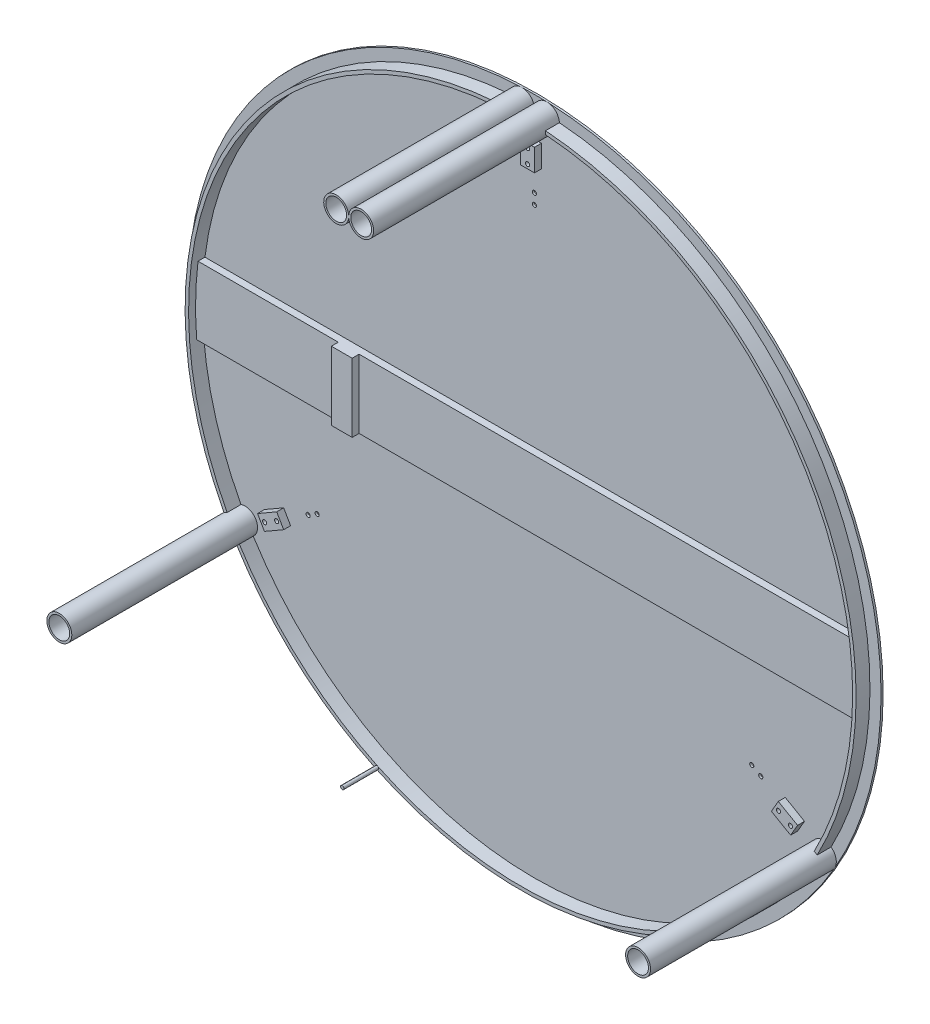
ISO-10303-21;
HEADER;
FILE_DESCRIPTION(('STEP AP214'),'2;1');
FILE_NAME('part.step','',(''),(''),'','','');
FILE_SCHEMA(('AUTOMOTIVE_DESIGN { 1 0 10303 214 1 1 1 1 }'));
ENDSEC;
DATA;
#1=APPLICATION_CONTEXT('core data for automotive mechanical design processes');
#2=APPLICATION_PROTOCOL_DEFINITION('international standard','automotive_design',2000,#1);
#3=PRODUCT_CONTEXT('',#1,'mechanical');
#4=PRODUCT('Part','Part','',(#3));
#5=PRODUCT_RELATED_PRODUCT_CATEGORY('part','',(#4));
#6=PRODUCT_DEFINITION_FORMATION('','',#4);
#7=PRODUCT_DEFINITION_CONTEXT('part definition',#1,'design');
#8=PRODUCT_DEFINITION('design','',#6,#7);
#9=PRODUCT_DEFINITION_SHAPE('','',#8);
#10=(LENGTH_UNIT() NAMED_UNIT(*) SI_UNIT(.MILLI.,.METRE.));
#11=(NAMED_UNIT(*) PLANE_ANGLE_UNIT() SI_UNIT($,.RADIAN.));
#12=(NAMED_UNIT(*) SI_UNIT($,.STERADIAN.) SOLID_ANGLE_UNIT());
#13=UNCERTAINTY_MEASURE_WITH_UNIT(LENGTH_MEASURE(1.E-05),#10,'distance_accuracy_value','');
#14=(GEOMETRIC_REPRESENTATION_CONTEXT(3) GLOBAL_UNCERTAINTY_ASSIGNED_CONTEXT((#13)) GLOBAL_UNIT_ASSIGNED_CONTEXT((#10,
#11,#12)) REPRESENTATION_CONTEXT('',''));
#15=CARTESIAN_POINT('',(0.,0.,0.));
#16=DIRECTION('',(0.,0.,1.));
#17=DIRECTION('',(1.,0.,0.));
#18=AXIS2_PLACEMENT_3D('',#15,#16,#17);
#19=CARTESIAN_POINT('',(-1065.3671318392,10.3318915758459,3.));
#20=DIRECTION('',(0.,0.,-1.));
#21=DIRECTION('',(-1.,0.,0.));
#22=AXIS2_PLACEMENT_3D('',#19,#20,#21);
#23=PLANE('',#22);
#24=CARTESIAN_POINT('',(313.501196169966,-181.000000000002,3.));
#25=DIRECTION('',(0.,0.,1.));
#26=DIRECTION('',(1.,0.,0.));
#27=AXIS2_PLACEMENT_3D('',#24,#25,#26);
#28=CIRCLE('',#27,2.99999999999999);
#29=CARTESIAN_POINT('',(316.501196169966,-181.000000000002,3.));
#30=VERTEX_POINT('',#29);
#31=EDGE_CURVE('E1785',#30,#30,#28,.T.);
#32=ORIENTED_EDGE('',*,*,#31,.F.);
#33=EDGE_LOOP('',(#32));
#34=FACE_BOUND('',#33,.T.);
#35=CARTESIAN_POINT('',(326.491577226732,-188.500000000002,3.));
#36=DIRECTION('',(0.,0.,1.));
#37=DIRECTION('',(1.,0.,0.));
#38=AXIS2_PLACEMENT_3D('',#35,#36,#37);
#39=CIRCLE('',#38,2.99999999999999);
#40=CARTESIAN_POINT('',(329.491577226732,-188.500000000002,3.));
#41=VERTEX_POINT('',#40);
#42=EDGE_CURVE('E1791',#41,#41,#39,.T.);
#43=ORIENTED_EDGE('',*,*,#42,.F.);
#44=EDGE_LOOP('',(#43));
#45=FACE_BOUND('',#44,.T.);
#46=CARTESIAN_POINT('',(-313.501196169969,-180.999999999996,3.));
#47=DIRECTION('',(0.,0.,1.));
#48=DIRECTION('',(1.,0.,0.));
#49=AXIS2_PLACEMENT_3D('',#46,#47,#48);
#50=CIRCLE('',#49,3.00000000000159);
#51=CARTESIAN_POINT('',(-310.501196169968,-180.999999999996,3.));
#52=VERTEX_POINT('',#51);
#53=EDGE_CURVE('E1797',#52,#52,#50,.T.);
#54=ORIENTED_EDGE('',*,*,#53,.F.);
#55=EDGE_LOOP('',(#54));
#56=FACE_BOUND('',#55,.T.);
#57=CARTESIAN_POINT('',(-326.491577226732,-188.500000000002,3.));
#58=DIRECTION('',(0.,0.,1.));
#59=DIRECTION('',(1.,0.,0.));
#60=AXIS2_PLACEMENT_3D('',#57,#58,#59);
#61=CIRCLE('',#60,2.99999999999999);
#62=CARTESIAN_POINT('',(-323.491577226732,-188.500000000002,3.));
#63=VERTEX_POINT('',#62);
#64=EDGE_CURVE('E1803',#63,#63,#61,.T.);
#65=ORIENTED_EDGE('',*,*,#64,.F.);
#66=EDGE_LOOP('',(#65));
#67=FACE_BOUND('',#66,.T.);
#68=DIRECTION('',(0.500000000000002,-0.866025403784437,0.));
#69=VECTOR('',#68,1.);
#70=CARTESIAN_POINT('',(-389.51527928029,-213.339745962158,3.));
#71=LINE('',#70,#69);
#72=CARTESIAN_POINT('',(-389.51527928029,-213.339745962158,3.));
#73=VERTEX_POINT('',#72);
#74=CARTESIAN_POINT('',(-379.515279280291,-230.660254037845,3.));
#75=VERTEX_POINT('',#74);
#76=EDGE_CURVE('E330',#73,#75,#71,.T.);
#77=ORIENTED_EDGE('',*,*,#76,.F.);
#78=DIRECTION('',(-0.866025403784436,-0.500000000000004,0.));
#79=VECTOR('',#78,1.);
#80=CARTESIAN_POINT('',(-389.51527928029,-213.339745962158,3.));
#81=LINE('',#80,#79);
#82=CARTESIAN_POINT('',(-361.802466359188,-197.339745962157,3.));
#83=VERTEX_POINT('',#82);
#84=EDGE_CURVE('E343',#83,#73,#81,.T.);
#85=ORIENTED_EDGE('',*,*,#84,.F.);
#86=DIRECTION('',(-0.500000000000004,0.866025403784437,0.));
#87=VECTOR('',#86,1.);
#88=CARTESIAN_POINT('',(-361.802466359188,-197.339745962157,3.));
#89=LINE('',#88,#87);
#90=CARTESIAN_POINT('',(-351.802466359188,-214.660254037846,3.));
#91=VERTEX_POINT('',#90);
#92=EDGE_CURVE('E352',#91,#83,#89,.T.);
#93=ORIENTED_EDGE('',*,*,#92,.F.);
#94=DIRECTION('',(0.866025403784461,0.499999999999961,0.));
#95=VECTOR('',#94,1.);
#96=CARTESIAN_POINT('',(-379.515279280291,-230.660254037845,3.));
#97=LINE('',#96,#95);
#98=EDGE_CURVE('E333',#75,#91,#97,.T.);
#99=ORIENTED_EDGE('',*,*,#98,.F.);
#100=EDGE_LOOP('',(#77,#85,#93,#99));
#101=FACE_BOUND('',#100,.T.);
#102=DIRECTION('',(1.,0.,0.));
#103=VECTOR('',#102,1.);
#104=CARTESIAN_POINT('',(-477.328584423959,-39.9802762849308,3.));
#105=LINE('',#104,#103);
#106=CARTESIAN_POINT('',(-477.328584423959,-39.9802762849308,3.));
#107=VERTEX_POINT('',#106);
#108=CARTESIAN_POINT('',(477.328584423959,-39.9802762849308,3.));
#109=VERTEX_POINT('',#108);
#110=EDGE_CURVE('E450',#107,#109,#105,.T.);
#111=ORIENTED_EDGE('',*,*,#110,.F.);
#112=CARTESIAN_POINT('',(0.,0.,3.));
#113=DIRECTION('',(0.,0.,-1.));
#114=DIRECTION('',(-1.,0.,0.));
#115=AXIS2_PLACEMENT_3D('',#112,#113,#114);
#116=CIRCLE('',#115,479.);
#117=CARTESIAN_POINT('',(-423.388134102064,-224.016713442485,3.));
#118=VERTEX_POINT('',#117);
#119=EDGE_CURVE('E502',#118,#107,#116,.T.);
#120=ORIENTED_EDGE('',*,*,#119,.F.);
#121=CARTESIAN_POINT('',(-417.4242446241,-240.999999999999,3.));
#122=DIRECTION('',(0.,0.,-1.));
#123=DIRECTION('',(-1.,0.,0.));
#124=AXIS2_PLACEMENT_3D('',#121,#122,#123);
#125=CIRCLE('',#124,18.);
#126=CARTESIAN_POINT('',(-405.698231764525,-254.656523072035,3.));
#127=VERTEX_POINT('',#126);
#128=EDGE_CURVE('E505',#118,#127,#125,.T.);
#129=ORIENTED_EDGE('',*,*,#128,.T.);
#130=CARTESIAN_POINT('',(0.,0.,3.));
#131=DIRECTION('',(0.,0.,-1.));
#132=DIRECTION('',(-1.,0.,0.));
#133=AXIS2_PLACEMENT_3D('',#130,#131,#132);
#134=CIRCLE('',#133,479.);
#135=CARTESIAN_POINT('',(405.698231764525,-254.656523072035,3.));
#136=VERTEX_POINT('',#135);
#137=EDGE_CURVE('E508',#136,#127,#134,.T.);
#138=ORIENTED_EDGE('',*,*,#137,.F.);
#139=CARTESIAN_POINT('',(417.4242446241,-240.999999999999,3.));
#140=DIRECTION('',(0.,0.,-1.));
#141=DIRECTION('',(-1.,0.,0.));
#142=AXIS2_PLACEMENT_3D('',#139,#140,#141);
#143=CIRCLE('',#142,17.9999999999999);
#144=CARTESIAN_POINT('',(423.388134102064,-224.016713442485,3.));
#145=VERTEX_POINT('',#144);
#146=EDGE_CURVE('E510',#136,#145,#143,.T.);
#147=ORIENTED_EDGE('',*,*,#146,.T.);
#148=CARTESIAN_POINT('',(0.,0.,3.));
#149=DIRECTION('',(0.,0.,-1.));
#150=DIRECTION('',(-1.,0.,0.));
#151=AXIS2_PLACEMENT_3D('',#148,#149,#150);
#152=CIRCLE('',#151,479.);
#153=EDGE_CURVE('E513',#109,#145,#152,.T.);
#154=ORIENTED_EDGE('',*,*,#153,.F.);
#155=EDGE_LOOP('',(#111,#120,#129,#138,#147,#154));
#156=FACE_BOUND('',#155,.T.);
#157=DIRECTION('',(0.499999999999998,0.86602540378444,0.));
#158=VECTOR('',#157,1.);
#159=CARTESIAN_POINT('',(379.51527928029,-230.660254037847,3.));
#160=LINE('',#159,#158);
#161=CARTESIAN_POINT('',(379.51527928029,-230.660254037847,3.));
#162=VERTEX_POINT('',#161);
#163=CARTESIAN_POINT('',(389.51527928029,-213.339745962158,3.));
#164=VERTEX_POINT('',#163);
#165=EDGE_CURVE('E329',#162,#164,#160,.T.);
#166=ORIENTED_EDGE('',*,*,#165,.F.);
#167=DIRECTION('',(0.866025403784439,-0.499999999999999,0.));
#168=VECTOR('',#167,1.);
#169=CARTESIAN_POINT('',(379.51527928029,-230.660254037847,3.));
#170=LINE('',#169,#168);
#171=CARTESIAN_POINT('',(351.802466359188,-214.660254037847,3.));
#172=VERTEX_POINT('',#171);
#173=EDGE_CURVE('E326',#172,#162,#170,.T.);
#174=ORIENTED_EDGE('',*,*,#173,.F.);
#175=DIRECTION('',(-0.499999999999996,-0.866025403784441,0.));
#176=VECTOR('',#175,1.);
#177=CARTESIAN_POINT('',(351.802466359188,-214.660254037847,3.));
#178=LINE('',#177,#176);
#179=CARTESIAN_POINT('',(361.802466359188,-197.339745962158,3.));
#180=VERTEX_POINT('',#179);
#181=EDGE_CURVE('E78',#180,#172,#178,.T.);
#182=ORIENTED_EDGE('',*,*,#181,.F.);
#183=DIRECTION('',(-0.866025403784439,0.499999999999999,0.));
#184=VECTOR('',#183,1.);
#185=CARTESIAN_POINT('',(389.51527928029,-213.339745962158,3.));
#186=LINE('',#185,#184);
#187=EDGE_CURVE('E73',#164,#180,#186,.T.);
#188=ORIENTED_EDGE('',*,*,#187,.F.);
#189=EDGE_LOOP('',(#166,#174,#182,#188));
#190=FACE_BOUND('',#189,.T.);
#191=ADVANCED_FACE('F56',(#34,#45,#56,#67,#101,#156,#190),#23,.F.);
#192=CARTESIAN_POINT('',(0.,362.,3.));
#193=DIRECTION('',(0.,0.,1.));
#194=DIRECTION('',(1.,0.,0.));
#195=AXIS2_PLACEMENT_3D('',#192,#193,#194);
#196=CIRCLE('',#195,3.);
#197=CARTESIAN_POINT('',(3.,362.,3.));
#198=VERTEX_POINT('',#197);
#199=EDGE_CURVE('E1773',#198,#198,#196,.T.);
#200=ORIENTED_EDGE('',*,*,#199,.F.);
#201=EDGE_LOOP('',(#200));
#202=FACE_BOUND('',#201,.T.);
#203=CARTESIAN_POINT('',(0.,377.,3.));
#204=DIRECTION('',(0.,0.,1.));
#205=DIRECTION('',(1.,0.,0.));
#206=AXIS2_PLACEMENT_3D('',#203,#204,#205);
#207=CIRCLE('',#206,3.);
#208=CARTESIAN_POINT('',(3.,377.,3.));
#209=VERTEX_POINT('',#208);
#210=EDGE_CURVE('E1779',#209,#209,#207,.T.);
#211=ORIENTED_EDGE('',*,*,#210,.F.);
#212=EDGE_LOOP('',(#211));
#213=FACE_BOUND('',#212,.T.);
#214=DIRECTION('',(-1.,0.,0.));
#215=VECTOR('',#214,1.);
#216=CARTESIAN_POINT('',(-475.352500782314,58.9999999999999,3.));
#217=LINE('',#216,#215);
#218=CARTESIAN_POINT('',(475.352500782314,58.9999999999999,3.));
#219=VERTEX_POINT('',#218);
#220=CARTESIAN_POINT('',(-475.352500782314,58.9999999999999,3.));
#221=VERTEX_POINT('',#220);
#222=EDGE_CURVE('E457',#219,#221,#217,.T.);
#223=ORIENTED_EDGE('',*,*,#222,.F.);
#224=CARTESIAN_POINT('',(35.5533268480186,477.67872147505,3.));
#225=VERTEX_POINT('',#224);
#226=EDGE_CURVE('E514',#225,#219,#152,.T.);
#227=ORIENTED_EDGE('',*,*,#226,.F.);
#228=CARTESIAN_POINT('',(18.,481.663783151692,3.));
#229=DIRECTION('',(0.,0.,-1.));
#230=DIRECTION('',(-1.,0.,0.));
#231=AXIS2_PLACEMENT_3D('',#228,#229,#230);
#232=CIRCLE('',#231,18.0000000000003);
#233=CARTESIAN_POINT('',(0.198201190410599,478.999958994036,3.));
#234=VERTEX_POINT('',#233);
#235=EDGE_CURVE('E517',#225,#234,#232,.T.);
#236=ORIENTED_EDGE('',*,*,#235,.T.);
#237=CARTESIAN_POINT('',(0.,0.,3.));
#238=DIRECTION('',(0.,0.,-1.));
#239=DIRECTION('',(-1.,0.,0.));
#240=AXIS2_PLACEMENT_3D('',#237,#238,#239);
#241=CIRCLE('',#240,479.);
#242=CARTESIAN_POINT('',(-0.198201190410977,478.999958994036,3.));
#243=VERTEX_POINT('',#242);
#244=EDGE_CURVE('E495',#243,#234,#241,.T.);
#245=ORIENTED_EDGE('',*,*,#244,.F.);
#246=CARTESIAN_POINT('',(-18.,481.663783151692,3.));
#247=DIRECTION('',(0.,0.,-1.));
#248=DIRECTION('',(-1.,0.,0.));
#249=AXIS2_PLACEMENT_3D('',#246,#247,#248);
#250=CIRCLE('',#249,17.9999999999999);
#251=CARTESIAN_POINT('',(-35.5533268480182,477.67872147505,3.));
#252=VERTEX_POINT('',#251);
#253=EDGE_CURVE('E497',#243,#252,#250,.T.);
#254=ORIENTED_EDGE('',*,*,#253,.T.);
#255=EDGE_CURVE('E501',#221,#252,#116,.T.);
#256=ORIENTED_EDGE('',*,*,#255,.F.);
#257=EDGE_LOOP('',(#223,#227,#236,#245,#254,#256));
#258=FACE_BOUND('',#257,.T.);
#259=DIRECTION('',(0.,1.,0.));
#260=VECTOR('',#259,1.);
#261=CARTESIAN_POINT('',(10.,444.,3.));
#262=LINE('',#261,#260);
#263=CARTESIAN_POINT('',(10.,412.,3.));
#264=VERTEX_POINT('',#263);
#265=CARTESIAN_POINT('',(10.,444.,3.));
#266=VERTEX_POINT('',#265);
#267=EDGE_CURVE('E368',#264,#266,#262,.T.);
#268=ORIENTED_EDGE('',*,*,#267,.F.);
#269=DIRECTION('',(1.,0.,0.));
#270=VECTOR('',#269,1.);
#271=CARTESIAN_POINT('',(10.,412.,3.));
#272=LINE('',#271,#270);
#273=CARTESIAN_POINT('',(-10.,412.,3.));
#274=VERTEX_POINT('',#273);
#275=EDGE_CURVE('E373',#274,#264,#272,.T.);
#276=ORIENTED_EDGE('',*,*,#275,.F.);
#277=DIRECTION('',(0.,-1.,0.));
#278=VECTOR('',#277,1.);
#279=CARTESIAN_POINT('',(-9.99999999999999,444.,3.));
#280=LINE('',#279,#278);
#281=CARTESIAN_POINT('',(-10.0000000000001,444.,3.));
#282=VERTEX_POINT('',#281);
#283=EDGE_CURVE('E385',#282,#274,#280,.T.);
#284=ORIENTED_EDGE('',*,*,#283,.F.);
#285=DIRECTION('',(-1.,0.,0.));
#286=VECTOR('',#285,1.);
#287=CARTESIAN_POINT('',(10.,444.,3.));
#288=LINE('',#287,#286);
#289=EDGE_CURVE('E382',#266,#282,#288,.T.);
#290=ORIENTED_EDGE('',*,*,#289,.F.);
#291=EDGE_LOOP('',(#268,#276,#284,#290));
#292=FACE_BOUND('',#291,.T.);
#293=ADVANCED_FACE('F676',(#202,#213,#258,#292),#23,.F.);
#294=CARTESIAN_POINT('',(0.,0.,13.));
#295=DIRECTION('',(0.,0.,1.));
#296=DIRECTION('',(1.,0.,0.));
#297=AXIS2_PLACEMENT_3D('',#294,#295,#296);
#298=PLANE('',#297);
#299=DIRECTION('',(1.,0.,0.));
#300=VECTOR('',#299,1.);
#301=CARTESIAN_POINT('',(-477.328584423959,-39.9802762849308,13.));
#302=LINE('',#301,#300);
#303=CARTESIAN_POINT('',(-477.328584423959,-39.9802762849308,13.));
#304=VERTEX_POINT('',#303);
#305=CARTESIAN_POINT('',(-273.,-39.9802762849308,13.));
#306=VERTEX_POINT('',#305);
#307=EDGE_CURVE('E458',#304,#306,#302,.T.);
#308=ORIENTED_EDGE('',*,*,#307,.T.);
#309=DIRECTION('',(0.,-1.,0.));
#310=VECTOR('',#309,1.);
#311=CARTESIAN_POINT('',(-273.,58.9999999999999,13.));
#312=LINE('',#311,#310);
#313=CARTESIAN_POINT('',(-273.,58.9999999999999,13.));
#314=VERTEX_POINT('',#313);
#315=EDGE_CURVE('E401',#314,#306,#312,.T.);
#316=ORIENTED_EDGE('',*,*,#315,.F.);
#317=DIRECTION('',(-1.,0.,0.));
#318=VECTOR('',#317,1.);
#319=CARTESIAN_POINT('',(-475.352500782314,58.9999999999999,13.));
#320=LINE('',#319,#318);
#321=CARTESIAN_POINT('',(-475.352500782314,58.9999999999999,13.));
#322=VERTEX_POINT('',#321);
#323=EDGE_CURVE('E463',#314,#322,#320,.T.);
#324=ORIENTED_EDGE('',*,*,#323,.T.);
#325=CARTESIAN_POINT('',(0.,0.,13.));
#326=DIRECTION('',(0.,0.,1.));
#327=DIRECTION('',(1.,0.,0.));
#328=AXIS2_PLACEMENT_3D('',#325,#326,#327);
#329=CIRCLE('',#328,479.);
#330=EDGE_CURVE('E453',#322,#304,#329,.T.);
#331=ORIENTED_EDGE('',*,*,#330,.T.);
#332=EDGE_LOOP('',(#308,#316,#324,#331));
#333=FACE_BOUND('',#332,.T.);
#334=ADVANCED_FACE('F682',(#333),#298,.T.);
#335=CARTESIAN_POINT('',(475.352500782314,58.9999999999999,13.));
#336=VERTEX_POINT('',#335);
#337=CARTESIAN_POINT('',(-243.,58.9999999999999,13.));
#338=VERTEX_POINT('',#337);
#339=EDGE_CURVE('E464',#336,#338,#320,.T.);
#340=ORIENTED_EDGE('',*,*,#339,.T.);
#341=DIRECTION('',(0.,1.,0.));
#342=VECTOR('',#341,1.);
#343=CARTESIAN_POINT('',(-243.,58.9999999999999,13.));
#344=LINE('',#343,#342);
#345=CARTESIAN_POINT('',(-243.,-39.9802762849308,13.));
#346=VERTEX_POINT('',#345);
#347=EDGE_CURVE('E406',#346,#338,#344,.T.);
#348=ORIENTED_EDGE('',*,*,#347,.F.);
#349=CARTESIAN_POINT('',(477.328584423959,-39.9802762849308,13.));
#350=VERTEX_POINT('',#349);
#351=EDGE_CURVE('E456',#346,#350,#302,.T.);
#352=ORIENTED_EDGE('',*,*,#351,.T.);
#353=CARTESIAN_POINT('',(0.,0.,13.));
#354=DIRECTION('',(0.,0.,1.));
#355=DIRECTION('',(1.,0.,0.));
#356=AXIS2_PLACEMENT_3D('',#353,#354,#355);
#357=CIRCLE('',#356,479.);
#358=EDGE_CURVE('E460',#350,#336,#357,.T.);
#359=ORIENTED_EDGE('',*,*,#358,.T.);
#360=EDGE_LOOP('',(#340,#348,#352,#359));
#361=FACE_BOUND('',#360,.T.);
#362=ADVANCED_FACE('F694',(#361),#298,.T.);
#363=CARTESIAN_POINT('',(0.,0.,3.));
#364=DIRECTION('',(0.,0.,1.));
#365=DIRECTION('',(1.,0.,0.));
#366=AXIS2_PLACEMENT_3D('',#363,#364,#365);
#367=CYLINDRICAL_SURFACE('',#366,479.);
#368=ORIENTED_EDGE('',*,*,#358,.F.);
#369=DIRECTION('',(0.,0.,-1.));
#370=VECTOR('',#369,1.);
#371=CARTESIAN_POINT('',(477.328584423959,-39.9802762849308,13.));
#372=LINE('',#371,#370);
#373=EDGE_CURVE('E476',#350,#109,#372,.T.);
#374=ORIENTED_EDGE('',*,*,#373,.T.);
#375=ORIENTED_EDGE('',*,*,#153,.T.);
#376=DIRECTION('',(0.,0.,1.));
#377=VECTOR('',#376,1.);
#378=CARTESIAN_POINT('',(423.388134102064,-224.016713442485,3.));
#379=LINE('',#378,#377);
#380=CARTESIAN_POINT('',(423.388134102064,-224.016713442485,23.));
#381=VERTEX_POINT('',#380);
#382=EDGE_CURVE('E530',#145,#381,#379,.T.);
#383=ORIENTED_EDGE('',*,*,#382,.T.);
#384=CARTESIAN_POINT('',(0.,0.,23.));
#385=DIRECTION('',(0.,0.,1.));
#386=DIRECTION('',(1.,0.,0.));
#387=AXIS2_PLACEMENT_3D('',#384,#385,#386);
#388=CIRCLE('',#387,479.);
#389=CARTESIAN_POINT('',(35.5533268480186,477.67872147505,23.));
#390=VERTEX_POINT('',#389);
#391=EDGE_CURVE('E588',#381,#390,#388,.T.);
#392=ORIENTED_EDGE('',*,*,#391,.T.);
#393=DIRECTION('',(0.,0.,1.));
#394=VECTOR('',#393,1.);
#395=CARTESIAN_POINT('',(35.5533268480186,477.67872147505,3.));
#396=LINE('',#395,#394);
#397=EDGE_CURVE('E527',#225,#390,#396,.T.);
#398=ORIENTED_EDGE('',*,*,#397,.F.);
#399=ORIENTED_EDGE('',*,*,#226,.T.);
#400=DIRECTION('',(0.,0.,-1.));
#401=VECTOR('',#400,1.);
#402=CARTESIAN_POINT('',(475.352500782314,58.9999999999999,13.));
#403=LINE('',#402,#401);
#404=EDGE_CURVE('E473',#336,#219,#403,.T.);
#405=ORIENTED_EDGE('',*,*,#404,.F.);
#406=EDGE_LOOP('',(#368,#374,#375,#383,#392,#398,#399,#405));
#407=FACE_BOUND('',#406,.T.);
#408=ADVANCED_FACE('F690',(#407),#367,.F.);
#409=CARTESIAN_POINT('',(0.,0.,3.));
#410=DIRECTION('',(0.,0.,1.));
#411=DIRECTION('',(1.,0.,0.));
#412=AXIS2_PLACEMENT_3D('',#409,#410,#411);
#413=CYLINDRICAL_SURFACE('',#412,479.);
#414=ORIENTED_EDGE('',*,*,#119,.T.);
#415=DIRECTION('',(0.,0.,-1.));
#416=VECTOR('',#415,1.);
#417=CARTESIAN_POINT('',(-477.328584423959,-39.9802762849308,13.));
#418=LINE('',#417,#416);
#419=EDGE_CURVE('E478',#304,#107,#418,.T.);
#420=ORIENTED_EDGE('',*,*,#419,.F.);
#421=ORIENTED_EDGE('',*,*,#330,.F.);
#422=DIRECTION('',(0.,0.,-1.));
#423=VECTOR('',#422,1.);
#424=CARTESIAN_POINT('',(-475.352500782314,58.9999999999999,13.));
#425=LINE('',#424,#423);
#426=EDGE_CURVE('E466',#322,#221,#425,.T.);
#427=ORIENTED_EDGE('',*,*,#426,.T.);
#428=ORIENTED_EDGE('',*,*,#255,.T.);
#429=DIRECTION('',(0.,0.,1.));
#430=VECTOR('',#429,1.);
#431=CARTESIAN_POINT('',(-35.5533268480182,477.67872147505,3.));
#432=LINE('',#431,#430);
#433=CARTESIAN_POINT('',(-35.5533268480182,477.67872147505,23.));
#434=VERTEX_POINT('',#433);
#435=EDGE_CURVE('E540',#252,#434,#432,.T.);
#436=ORIENTED_EDGE('',*,*,#435,.T.);
#437=CARTESIAN_POINT('',(0.,0.,23.));
#438=DIRECTION('',(0.,0.,1.));
#439=DIRECTION('',(1.,0.,0.));
#440=AXIS2_PLACEMENT_3D('',#437,#438,#439);
#441=CIRCLE('',#440,479.);
#442=CARTESIAN_POINT('',(-423.388134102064,-224.016713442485,23.));
#443=VERTEX_POINT('',#442);
#444=EDGE_CURVE('E607',#434,#443,#441,.T.);
#445=ORIENTED_EDGE('',*,*,#444,.T.);
#446=DIRECTION('',(0.,0.,1.));
#447=VECTOR('',#446,1.);
#448=CARTESIAN_POINT('',(-423.388134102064,-224.016713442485,3.));
#449=LINE('',#448,#447);
#450=EDGE_CURVE('E537',#118,#443,#449,.T.);
#451=ORIENTED_EDGE('',*,*,#450,.F.);
#452=EDGE_LOOP('',(#414,#420,#421,#427,#428,#436,#445,#451));
#453=FACE_BOUND('',#452,.T.);
#454=ADVANCED_FACE('F693',(#453),#413,.F.);
#455=CARTESIAN_POINT('',(-208.71212231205,-120.5,23.));
#456=DIRECTION('',(0.,0.,1.));
#457=DIRECTION('',(1.,0.,0.));
#458=AXIS2_PLACEMENT_3D('',#455,#456,#457);
#459=PLANE('',#458);
#460=CARTESIAN_POINT('',(0.,0.,23.));
#461=DIRECTION('',(0.,0.,1.));
#462=DIRECTION('',(1.,0.,0.));
#463=AXIS2_PLACEMENT_3D('',#460,#461,#462);
#464=CIRCLE('',#463,484.);
#465=CARTESIAN_POINT('',(-208.367370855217,-436.851277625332,23.));
#466=VERTEX_POINT('',#465);
#467=CARTESIAN_POINT('',(208.367370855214,-436.851277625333,23.));
#468=VERTEX_POINT('',#467);
#469=EDGE_CURVE('E627',#466,#468,#464,.T.);
#470=ORIENTED_EDGE('',*,*,#469,.T.);
#471=CARTESIAN_POINT('',(207.291093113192,-434.594814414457,23.));
#472=DIRECTION('',(0.,0.,1.));
#473=DIRECTION('',(1.,0.,0.));
#474=AXIS2_PLACEMENT_3D('',#471,#472,#473);
#475=CIRCLE('',#474,2.5);
#476=CARTESIAN_POINT('',(206.214815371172,-432.338351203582,23.));
#477=VERTEX_POINT('',#476);
#478=EDGE_CURVE('E487',#468,#477,#475,.F.);
#479=ORIENTED_EDGE('',*,*,#478,.T.);
#480=CARTESIAN_POINT('',(0.,0.,23.));
#481=DIRECTION('',(0.,0.,1.));
#482=DIRECTION('',(1.,0.,0.));
#483=AXIS2_PLACEMENT_3D('',#480,#481,#482);
#484=CIRCLE('',#483,479.);
#485=CARTESIAN_POINT('',(-206.214815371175,-432.338351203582,23.));
#486=VERTEX_POINT('',#485);
#487=EDGE_CURVE('E619',#486,#477,#484,.T.);
#488=ORIENTED_EDGE('',*,*,#487,.F.);
#489=CARTESIAN_POINT('',(-207.291093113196,-434.594814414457,23.));
#490=DIRECTION('',(0.,0.,1.));
#491=DIRECTION('',(1.,0.,0.));
#492=AXIS2_PLACEMENT_3D('',#489,#490,#491);
#493=CIRCLE('',#492,2.5);
#494=EDGE_CURVE('E491',#486,#466,#493,.F.);
#495=ORIENTED_EDGE('',*,*,#494,.T.);
#496=EDGE_LOOP('',(#470,#479,#488,#495));
#497=FACE_BOUND('',#496,.T.);
#498=ADVANCED_FACE('F703',(#497),#459,.T.);
#499=CARTESIAN_POINT('',(405.698231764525,-254.656523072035,23.));
#500=VERTEX_POINT('',#499);
#501=EDGE_CURVE('E614',#477,#500,#484,.T.);
#502=ORIENTED_EDGE('',*,*,#501,.F.);
#503=EDGE_CURVE('E484',#477,#468,#475,.F.);
#504=ORIENTED_EDGE('',*,*,#503,.T.);
#505=CARTESIAN_POINT('',(409.907545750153,-257.355403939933,23.));
#506=VERTEX_POINT('',#505);
#507=EDGE_CURVE('E622',#468,#506,#464,.T.);
#508=ORIENTED_EDGE('',*,*,#507,.T.);
#509=CARTESIAN_POINT('',(417.4242446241,-240.999999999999,23.));
#510=DIRECTION('',(0.,0.,1.));
#511=DIRECTION('',(1.,0.,0.));
#512=AXIS2_PLACEMENT_3D('',#509,#510,#511);
#513=CIRCLE('',#512,18.);
#514=EDGE_CURVE('E618',#500,#506,#513,.T.);
#515=ORIENTED_EDGE('',*,*,#514,.F.);
#516=EDGE_LOOP('',(#502,#504,#508,#515));
#517=FACE_BOUND('',#516,.T.);
#518=ADVANCED_FACE('F745',(#517),#459,.T.);
#519=CARTESIAN_POINT('',(-409.907545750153,-257.355403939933,23.));
#520=VERTEX_POINT('',#519);
#521=EDGE_CURVE('E623',#520,#466,#464,.T.);
#522=ORIENTED_EDGE('',*,*,#521,.T.);
#523=EDGE_CURVE('E494',#466,#486,#493,.F.);
#524=ORIENTED_EDGE('',*,*,#523,.T.);
#525=CARTESIAN_POINT('',(-405.698231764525,-254.656523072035,23.));
#526=VERTEX_POINT('',#525);
#527=EDGE_CURVE('E615',#526,#486,#484,.T.);
#528=ORIENTED_EDGE('',*,*,#527,.F.);
#529=CARTESIAN_POINT('',(-417.4242446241,-240.999999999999,23.));
#530=DIRECTION('',(0.,0.,1.));
#531=DIRECTION('',(1.,0.,0.));
#532=AXIS2_PLACEMENT_3D('',#529,#530,#531);
#533=CIRCLE('',#532,18.);
#534=EDGE_CURVE('E611',#520,#526,#533,.T.);
#535=ORIENTED_EDGE('',*,*,#534,.F.);
#536=EDGE_LOOP('',(#522,#524,#528,#535));
#537=FACE_BOUND('',#536,.T.);
#538=ADVANCED_FACE('F743',(#537),#459,.T.);
#539=CARTESIAN_POINT('',(0.,-1100.14142135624,271.));
#540=DIRECTION('',(0.,0.,1.));
#541=DIRECTION('',(1.,0.,0.));
#542=AXIS2_PLACEMENT_3D('',#539,#540,#541);
#543=PLANE('',#542);
#544=CARTESIAN_POINT('',(417.4242446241,-240.999999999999,271.));
#545=DIRECTION('',(0.,0.,1.));
#546=DIRECTION('',(1.,0.,0.));
#547=AXIS2_PLACEMENT_3D('',#544,#545,#546);
#548=CIRCLE('',#547,15.);
#549=CARTESIAN_POINT('',(432.4242446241,-240.999999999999,271.));
#550=VERTEX_POINT('',#549);
#551=EDGE_CURVE('E438',#550,#550,#548,.T.);
#552=ORIENTED_EDGE('',*,*,#551,.F.);
#553=EDGE_LOOP('',(#552));
#554=FACE_BOUND('',#553,.T.);
#555=CARTESIAN_POINT('',(417.4242446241,-240.999999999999,271.));
#556=DIRECTION('',(0.,0.,1.));
#557=DIRECTION('',(1.,0.,0.));
#558=AXIS2_PLACEMENT_3D('',#555,#556,#557);
#559=CIRCLE('',#558,18.);
#560=CARTESIAN_POINT('',(435.4242446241,-240.999999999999,271.));
#561=VERTEX_POINT('',#560);
#562=EDGE_CURVE('E567',#561,#561,#559,.T.);
#563=ORIENTED_EDGE('',*,*,#562,.T.);
#564=EDGE_LOOP('',(#563));
#565=FACE_BOUND('',#564,.T.);
#566=ADVANCED_FACE('F712',(#554,#565),#543,.T.);
#567=CARTESIAN_POINT('',(-417.4242446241,-240.999999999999,271.));
#568=DIRECTION('',(0.,0.,1.));
#569=DIRECTION('',(1.,0.,0.));
#570=AXIS2_PLACEMENT_3D('',#567,#568,#569);
#571=CIRCLE('',#570,15.);
#572=CARTESIAN_POINT('',(-402.4242446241,-240.999999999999,271.));
#573=VERTEX_POINT('',#572);
#574=EDGE_CURVE('E444',#573,#573,#571,.T.);
#575=ORIENTED_EDGE('',*,*,#574,.F.);
#576=EDGE_LOOP('',(#575));
#577=FACE_BOUND('',#576,.T.);
#578=CARTESIAN_POINT('',(-417.4242446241,-240.999999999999,271.));
#579=DIRECTION('',(0.,0.,1.));
#580=DIRECTION('',(1.,0.,0.));
#581=AXIS2_PLACEMENT_3D('',#578,#579,#580);
#582=CIRCLE('',#581,18.);
#583=CARTESIAN_POINT('',(-399.4242446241,-240.999999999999,271.));
#584=VERTEX_POINT('',#583);
#585=EDGE_CURVE('E546',#584,#584,#582,.T.);
#586=ORIENTED_EDGE('',*,*,#585,.T.);
#587=EDGE_LOOP('',(#586));
#588=FACE_BOUND('',#587,.T.);
#589=ADVANCED_FACE('F713',(#577,#588),#543,.T.);
#590=CARTESIAN_POINT('',(0.,0.,3.));
#591=DIRECTION('',(0.,0.,1.));
#592=DIRECTION('',(1.,0.,0.));
#593=AXIS2_PLACEMENT_3D('',#590,#591,#592);
#594=PLANE('',#593);
#595=CARTESIAN_POINT('',(0.,0.,3.));
#596=DIRECTION('',(0.,0.,1.));
#597=DIRECTION('',(1.,0.,0.));
#598=AXIS2_PLACEMENT_3D('',#595,#596,#597);
#599=CIRCLE('',#598,484.);
#600=CARTESIAN_POINT('',(-409.907545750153,-257.355403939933,3.));
#601=VERTEX_POINT('',#600);
#602=CARTESIAN_POINT('',(409.907545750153,-257.355403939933,3.));
#603=VERTEX_POINT('',#602);
#604=EDGE_CURVE('E601',#601,#603,#599,.T.);
#605=ORIENTED_EDGE('',*,*,#604,.F.);
#606=CARTESIAN_POINT('',(-417.4242446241,-240.999999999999,3.));
#607=DIRECTION('',(0.,0.,1.));
#608=DIRECTION('',(1.,0.,0.));
#609=AXIS2_PLACEMENT_3D('',#606,#607,#608);
#610=CIRCLE('',#609,18.);
#611=CARTESIAN_POINT('',(-433.01270189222,-249.999999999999,3.));
#612=VERTEX_POINT('',#611);
#613=EDGE_CURVE('E556',#612,#601,#610,.T.);
#614=ORIENTED_EDGE('',*,*,#613,.F.);
#615=CARTESIAN_POINT('',(0.,0.,3.));
#616=DIRECTION('',(0.,0.,1.));
#617=DIRECTION('',(1.,0.,0.));
#618=AXIS2_PLACEMENT_3D('',#615,#616,#617);
#619=CIRCLE('',#618,500.);
#620=CARTESIAN_POINT('',(433.01270189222,-249.999999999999,3.));
#621=VERTEX_POINT('',#620);
#622=EDGE_CURVE('E650',#612,#621,#619,.T.);
#623=ORIENTED_EDGE('',*,*,#622,.T.);
#624=CARTESIAN_POINT('',(417.4242446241,-240.999999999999,3.));
#625=DIRECTION('',(0.,0.,1.));
#626=DIRECTION('',(1.,0.,0.));
#627=AXIS2_PLACEMENT_3D('',#624,#625,#626);
#628=CIRCLE('',#627,18.);
#629=EDGE_CURVE('E570',#603,#621,#628,.T.);
#630=ORIENTED_EDGE('',*,*,#629,.F.);
#631=EDGE_LOOP('',(#605,#614,#623,#630));
#632=FACE_BOUND('',#631,.T.);
#633=ADVANCED_FACE('F648',(#632),#594,.T.);
#634=CARTESIAN_POINT('',(-18.6721991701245,499.65122733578,3.));
#635=VERTEX_POINT('',#634);
#636=EDGE_CURVE('E65',#635,#612,#619,.T.);
#637=ORIENTED_EDGE('',*,*,#636,.T.);
#638=CARTESIAN_POINT('',(-427.830090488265,-226.312645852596,3.));
#639=VERTEX_POINT('',#638);
#640=EDGE_CURVE('E560',#639,#612,#610,.T.);
#641=ORIENTED_EDGE('',*,*,#640,.F.);
#642=CARTESIAN_POINT('',(0.,0.,3.));
#643=DIRECTION('',(0.,0.,1.));
#644=DIRECTION('',(1.,0.,0.));
#645=AXIS2_PLACEMENT_3D('',#642,#643,#644);
#646=CIRCLE('',#645,484.);
#647=CARTESIAN_POINT('',(-35.9723352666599,482.661362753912,3.));
#648=VERTEX_POINT('',#647);
#649=EDGE_CURVE('E598',#648,#639,#646,.T.);
#650=ORIENTED_EDGE('',*,*,#649,.F.);
#651=CARTESIAN_POINT('',(-18.,481.663783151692,3.));
#652=DIRECTION('',(0.,0.,1.));
#653=DIRECTION('',(1.,0.,0.));
#654=AXIS2_PLACEMENT_3D('',#651,#652,#653);
#655=CIRCLE('',#654,18.);
#656=EDGE_CURVE('E557',#635,#648,#655,.T.);
#657=ORIENTED_EDGE('',*,*,#656,.F.);
#658=EDGE_LOOP('',(#637,#641,#650,#657));
#659=FACE_BOUND('',#658,.T.);
#660=ADVANCED_FACE('F748',(#659),#594,.T.);
#661=CARTESIAN_POINT('',(18.6721991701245,499.65122733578,3.));
#662=VERTEX_POINT('',#661);
#663=EDGE_CURVE('E66',#621,#662,#619,.T.);
#664=ORIENTED_EDGE('',*,*,#663,.T.);
#665=CARTESIAN_POINT('',(18.,481.663783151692,3.));
#666=DIRECTION('',(0.,0.,1.));
#667=DIRECTION('',(1.,0.,0.));
#668=AXIS2_PLACEMENT_3D('',#665,#666,#667);
#669=CIRCLE('',#668,18.0000000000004);
#670=CARTESIAN_POINT('',(35.9723352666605,482.661362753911,3.));
#671=VERTEX_POINT('',#670);
#672=EDGE_CURVE('E547',#671,#662,#669,.T.);
#673=ORIENTED_EDGE('',*,*,#672,.F.);
#674=CARTESIAN_POINT('',(0.,0.,3.));
#675=DIRECTION('',(0.,0.,1.));
#676=DIRECTION('',(1.,0.,0.));
#677=AXIS2_PLACEMENT_3D('',#674,#675,#676);
#678=CIRCLE('',#677,484.);
#679=CARTESIAN_POINT('',(427.830090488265,-226.312645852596,3.));
#680=VERTEX_POINT('',#679);
#681=EDGE_CURVE('E579',#680,#671,#678,.T.);
#682=ORIENTED_EDGE('',*,*,#681,.F.);
#683=EDGE_CURVE('E526',#621,#680,#628,.T.);
#684=ORIENTED_EDGE('',*,*,#683,.F.);
#685=EDGE_LOOP('',(#664,#673,#682,#684));
#686=FACE_BOUND('',#685,.T.);
#687=ADVANCED_FACE('F753',(#686),#594,.T.);
#688=CARTESIAN_POINT('',(0.,481.663783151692,3.));
#689=VERTEX_POINT('',#688);
#690=EDGE_CURVE('E553',#689,#635,#655,.T.);
#691=ORIENTED_EDGE('',*,*,#690,.F.);
#692=EDGE_CURVE('E561',#662,#689,#669,.T.);
#693=ORIENTED_EDGE('',*,*,#692,.F.);
#694=EDGE_CURVE('E12',#662,#635,#619,.T.);
#695=ORIENTED_EDGE('',*,*,#694,.T.);
#696=EDGE_LOOP('',(#691,#693,#695));
#697=FACE_BOUND('',#696,.T.);
#698=ADVANCED_FACE('F671',(#697),#594,.T.);
#699=CARTESIAN_POINT('',(0.,0.,3.));
#700=DIRECTION('',(0.,0.,-1.));
#701=DIRECTION('',(-1.,0.,0.));
#702=AXIS2_PLACEMENT_3D('',#699,#700,#701);
#703=CYLINDRICAL_SURFACE('',#702,500.);
#704=ORIENTED_EDGE('',*,*,#694,.F.);
#705=ORIENTED_EDGE('',*,*,#663,.F.);
#706=ORIENTED_EDGE('',*,*,#622,.F.);
#707=ORIENTED_EDGE('',*,*,#636,.F.);
#708=EDGE_LOOP('',(#704,#705,#706,#707));
#709=FACE_BOUND('',#708,.T.);
#710=CARTESIAN_POINT('',(0.,0.,0.));
#711=DIRECTION('',(0.,0.,1.));
#712=DIRECTION('',(1.,0.,0.));
#713=AXIS2_PLACEMENT_3D('',#710,#711,#712);
#714=CIRCLE('',#713,500.);
#715=CARTESIAN_POINT('',(500.,0.,0.));
#716=VERTEX_POINT('',#715);
#717=EDGE_CURVE('E60',#716,#716,#714,.T.);
#718=ORIENTED_EDGE('',*,*,#717,.T.);
#719=EDGE_LOOP('',(#718));
#720=FACE_BOUND('',#719,.T.);
#721=ADVANCED_FACE('F58',(#709,#720),#703,.T.);
#722=CARTESIAN_POINT('',(0.,0.,0.));
#723=DIRECTION('',(0.,0.,1.));
#724=DIRECTION('',(1.,0.,0.));
#725=AXIS2_PLACEMENT_3D('',#722,#723,#724);
#726=PLANE('',#725);
#727=CARTESIAN_POINT('',(18.,481.663783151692,0.));
#728=DIRECTION('',(0.,0.,1.));
#729=DIRECTION('',(1.,0.,0.));
#730=AXIS2_PLACEMENT_3D('',#727,#728,#729);
#731=CIRCLE('',#730,5.);
#732=CARTESIAN_POINT('',(23.,481.663783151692,0.));
#733=VERTEX_POINT('',#732);
#734=EDGE_CURVE('E1750',#733,#733,#731,.T.);
#735=ORIENTED_EDGE('',*,*,#734,.T.);
#736=EDGE_LOOP('',(#735));
#737=FACE_BOUND('',#736,.T.);
#738=CARTESIAN_POINT('',(-18.,481.663783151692,0.));
#739=DIRECTION('',(0.,0.,1.));
#740=DIRECTION('',(1.,0.,0.));
#741=AXIS2_PLACEMENT_3D('',#738,#739,#740);
#742=CIRCLE('',#741,5.);
#743=CARTESIAN_POINT('',(-13.,481.663783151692,0.));
#744=VERTEX_POINT('',#743);
#745=EDGE_CURVE('E1758',#744,#744,#742,.T.);
#746=ORIENTED_EDGE('',*,*,#745,.T.);
#747=EDGE_LOOP('',(#746));
#748=FACE_BOUND('',#747,.T.);
#749=CARTESIAN_POINT('',(417.4242446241,-240.999999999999,0.));
#750=DIRECTION('',(0.,0.,1.));
#751=DIRECTION('',(1.,0.,0.));
#752=AXIS2_PLACEMENT_3D('',#749,#750,#751);
#753=CIRCLE('',#752,4.99999999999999);
#754=CARTESIAN_POINT('',(422.4242446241,-240.999999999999,0.));
#755=VERTEX_POINT('',#754);
#756=EDGE_CURVE('E1764',#755,#755,#753,.T.);
#757=ORIENTED_EDGE('',*,*,#756,.T.);
#758=EDGE_LOOP('',(#757));
#759=FACE_BOUND('',#758,.T.);
#760=CARTESIAN_POINT('',(-417.4242446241,-240.999999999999,0.));
#761=DIRECTION('',(0.,0.,1.));
#762=DIRECTION('',(1.,0.,0.));
#763=AXIS2_PLACEMENT_3D('',#760,#761,#762);
#764=CIRCLE('',#763,4.99999999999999);
#765=CARTESIAN_POINT('',(-412.4242446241,-240.999999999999,0.));
#766=VERTEX_POINT('',#765);
#767=EDGE_CURVE('E1770',#766,#766,#764,.T.);
#768=ORIENTED_EDGE('',*,*,#767,.T.);
#769=EDGE_LOOP('',(#768));
#770=FACE_BOUND('',#769,.T.);
#771=CARTESIAN_POINT('',(0.,362.,0.));
#772=DIRECTION('',(0.,0.,1.));
#773=DIRECTION('',(1.,0.,0.));
#774=AXIS2_PLACEMENT_3D('',#771,#772,#773);
#775=CIRCLE('',#774,3.);
#776=CARTESIAN_POINT('',(3.,362.,0.));
#777=VERTEX_POINT('',#776);
#778=EDGE_CURVE('E1776',#777,#777,#775,.T.);
#779=ORIENTED_EDGE('',*,*,#778,.T.);
#780=EDGE_LOOP('',(#779));
#781=FACE_BOUND('',#780,.T.);
#782=CARTESIAN_POINT('',(0.,377.,0.));
#783=DIRECTION('',(0.,0.,1.));
#784=DIRECTION('',(1.,0.,0.));
#785=AXIS2_PLACEMENT_3D('',#782,#783,#784);
#786=CIRCLE('',#785,3.);
#787=CARTESIAN_POINT('',(3.,377.,0.));
#788=VERTEX_POINT('',#787);
#789=EDGE_CURVE('E1782',#788,#788,#786,.T.);
#790=ORIENTED_EDGE('',*,*,#789,.T.);
#791=EDGE_LOOP('',(#790));
#792=FACE_BOUND('',#791,.T.);
#793=CARTESIAN_POINT('',(313.501196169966,-181.000000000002,0.));
#794=DIRECTION('',(0.,0.,1.));
#795=DIRECTION('',(1.,0.,0.));
#796=AXIS2_PLACEMENT_3D('',#793,#794,#795);
#797=CIRCLE('',#796,2.99999999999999);
#798=CARTESIAN_POINT('',(316.501196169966,-181.000000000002,0.));
#799=VERTEX_POINT('',#798);
#800=EDGE_CURVE('E1788',#799,#799,#797,.T.);
#801=ORIENTED_EDGE('',*,*,#800,.T.);
#802=EDGE_LOOP('',(#801));
#803=FACE_BOUND('',#802,.T.);
#804=CARTESIAN_POINT('',(326.491577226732,-188.500000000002,0.));
#805=DIRECTION('',(0.,0.,1.));
#806=DIRECTION('',(1.,0.,0.));
#807=AXIS2_PLACEMENT_3D('',#804,#805,#806);
#808=CIRCLE('',#807,2.99999999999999);
#809=CARTESIAN_POINT('',(329.491577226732,-188.500000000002,0.));
#810=VERTEX_POINT('',#809);
#811=EDGE_CURVE('E1794',#810,#810,#808,.T.);
#812=ORIENTED_EDGE('',*,*,#811,.T.);
#813=EDGE_LOOP('',(#812));
#814=FACE_BOUND('',#813,.T.);
#815=CARTESIAN_POINT('',(-313.501196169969,-180.999999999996,0.));
#816=DIRECTION('',(0.,0.,1.));
#817=DIRECTION('',(1.,0.,0.));
#818=AXIS2_PLACEMENT_3D('',#815,#816,#817);
#819=CIRCLE('',#818,3.00000000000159);
#820=CARTESIAN_POINT('',(-310.501196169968,-180.999999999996,0.));
#821=VERTEX_POINT('',#820);
#822=EDGE_CURVE('E1800',#821,#821,#819,.T.);
#823=ORIENTED_EDGE('',*,*,#822,.T.);
#824=EDGE_LOOP('',(#823));
#825=FACE_BOUND('',#824,.T.);
#826=CARTESIAN_POINT('',(-326.491577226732,-188.500000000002,0.));
#827=DIRECTION('',(0.,0.,1.));
#828=DIRECTION('',(1.,0.,0.));
#829=AXIS2_PLACEMENT_3D('',#826,#827,#828);
#830=CIRCLE('',#829,2.99999999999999);
#831=CARTESIAN_POINT('',(-323.491577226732,-188.500000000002,0.));
#832=VERTEX_POINT('',#831);
#833=EDGE_CURVE('E1806',#832,#832,#830,.T.);
#834=ORIENTED_EDGE('',*,*,#833,.T.);
#835=EDGE_LOOP('',(#834));
#836=FACE_BOUND('',#835,.T.);
#837=ORIENTED_EDGE('',*,*,#717,.F.);
#838=EDGE_LOOP('',(#837));
#839=FACE_BOUND('',#838,.T.);
#840=ADVANCED_FACE('F662',(#737,#748,#759,#770,#781,#792,#803,#814,#825,#836,#839),#726,.F.);
#841=CARTESIAN_POINT('',(0.,0.,23.));
#842=DIRECTION('',(0.,0.,-1.));
#843=DIRECTION('',(-1.,0.,0.));
#844=AXIS2_PLACEMENT_3D('',#841,#842,#843);
#845=CYLINDRICAL_SURFACE('',#844,484.);
#846=ORIENTED_EDGE('',*,*,#507,.F.);
#847=ORIENTED_EDGE('',*,*,#469,.F.);
#848=ORIENTED_EDGE('',*,*,#521,.F.);
#849=DIRECTION('',(0.,0.,-1.));
#850=VECTOR('',#849,1.);
#851=CARTESIAN_POINT('',(-409.907545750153,-257.355403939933,23.));
#852=LINE('',#851,#850);
#853=EDGE_CURVE('E629',#520,#601,#852,.T.);
#854=ORIENTED_EDGE('',*,*,#853,.T.);
#855=ORIENTED_EDGE('',*,*,#604,.T.);
#856=DIRECTION('',(0.,0.,-1.));
#857=VECTOR('',#856,1.);
#858=CARTESIAN_POINT('',(409.907545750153,-257.355403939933,23.));
#859=LINE('',#858,#857);
#860=EDGE_CURVE('E626',#506,#603,#859,.T.);
#861=ORIENTED_EDGE('',*,*,#860,.F.);
#862=EDGE_LOOP('',(#846,#847,#848,#854,#855,#861));
#863=FACE_BOUND('',#862,.T.);
#864=ADVANCED_FACE('F642',(#863),#845,.T.);
#865=CARTESIAN_POINT('',(0.,0.,23.));
#866=DIRECTION('',(0.,0.,-1.));
#867=DIRECTION('',(-1.,0.,0.));
#868=AXIS2_PLACEMENT_3D('',#865,#866,#867);
#869=CYLINDRICAL_SURFACE('',#868,484.);
#870=ORIENTED_EDGE('',*,*,#649,.T.);
#871=DIRECTION('',(0.,0.,-1.));
#872=VECTOR('',#871,1.);
#873=CARTESIAN_POINT('',(-427.830090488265,-226.312645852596,23.));
#874=LINE('',#873,#872);
#875=CARTESIAN_POINT('',(-427.830090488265,-226.312645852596,23.));
#876=VERTEX_POINT('',#875);
#877=EDGE_CURVE('E592',#876,#639,#874,.T.);
#878=ORIENTED_EDGE('',*,*,#877,.F.);
#879=CARTESIAN_POINT('',(0.,0.,23.));
#880=DIRECTION('',(0.,0.,1.));
#881=DIRECTION('',(1.,0.,0.));
#882=AXIS2_PLACEMENT_3D('',#879,#880,#881);
#883=CIRCLE('',#882,484.);
#884=CARTESIAN_POINT('',(-35.9723352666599,482.661362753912,23.));
#885=VERTEX_POINT('',#884);
#886=EDGE_CURVE('E595',#885,#876,#883,.T.);
#887=ORIENTED_EDGE('',*,*,#886,.F.);
#888=DIRECTION('',(0.,0.,-1.));
#889=VECTOR('',#888,1.);
#890=CARTESIAN_POINT('',(-35.9723352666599,482.661362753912,23.));
#891=LINE('',#890,#889);
#892=EDGE_CURVE('E582',#885,#648,#891,.T.);
#893=ORIENTED_EDGE('',*,*,#892,.T.);
#894=EDGE_LOOP('',(#870,#878,#887,#893));
#895=FACE_BOUND('',#894,.T.);
#896=ADVANCED_FACE('F669',(#895),#869,.T.);
#897=CARTESIAN_POINT('',(-9.,240.831891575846,23.));
#898=DIRECTION('',(0.,0.,1.));
#899=DIRECTION('',(1.,0.,0.));
#900=AXIS2_PLACEMENT_3D('',#897,#898,#899);
#901=PLANE('',#900);
#902=CARTESIAN_POINT('',(-18.,481.663783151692,23.));
#903=DIRECTION('',(0.,0.,1.));
#904=DIRECTION('',(1.,0.,0.));
#905=AXIS2_PLACEMENT_3D('',#902,#903,#904);
#906=CIRCLE('',#905,17.9999999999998);
#907=EDGE_CURVE('E602',#885,#434,#906,.T.);
#908=ORIENTED_EDGE('',*,*,#907,.F.);
#909=ORIENTED_EDGE('',*,*,#886,.T.);
#910=CARTESIAN_POINT('',(-417.4242446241,-240.999999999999,23.));
#911=DIRECTION('',(0.,0.,1.));
#912=DIRECTION('',(1.,0.,0.));
#913=AXIS2_PLACEMENT_3D('',#910,#911,#912);
#914=CIRCLE('',#913,18.);
#915=EDGE_CURVE('E604',#443,#876,#914,.T.);
#916=ORIENTED_EDGE('',*,*,#915,.F.);
#917=ORIENTED_EDGE('',*,*,#444,.F.);
#918=EDGE_LOOP('',(#908,#909,#916,#917));
#919=FACE_BOUND('',#918,.T.);
#920=ADVANCED_FACE('F732',(#919),#901,.T.);
#921=CARTESIAN_POINT('',(0.,0.,23.));
#922=DIRECTION('',(0.,0.,-1.));
#923=DIRECTION('',(-1.,0.,0.));
#924=AXIS2_PLACEMENT_3D('',#921,#922,#923);
#925=CYLINDRICAL_SURFACE('',#924,484.);
#926=ORIENTED_EDGE('',*,*,#681,.T.);
#927=DIRECTION('',(0.,0.,-1.));
#928=VECTOR('',#927,1.);
#929=CARTESIAN_POINT('',(35.9723352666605,482.661362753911,23.));
#930=LINE('',#929,#928);
#931=CARTESIAN_POINT('',(35.9723352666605,482.661362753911,23.));
#932=VERTEX_POINT('',#931);
#933=EDGE_CURVE('E573',#932,#671,#930,.T.);
#934=ORIENTED_EDGE('',*,*,#933,.F.);
#935=CARTESIAN_POINT('',(0.,0.,23.));
#936=DIRECTION('',(0.,0.,1.));
#937=DIRECTION('',(1.,0.,0.));
#938=AXIS2_PLACEMENT_3D('',#935,#936,#937);
#939=CIRCLE('',#938,484.);
#940=CARTESIAN_POINT('',(427.830090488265,-226.312645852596,23.));
#941=VERTEX_POINT('',#940);
#942=EDGE_CURVE('E576',#941,#932,#939,.T.);
#943=ORIENTED_EDGE('',*,*,#942,.F.);
#944=DIRECTION('',(0.,0.,-1.));
#945=VECTOR('',#944,1.);
#946=CARTESIAN_POINT('',(427.830090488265,-226.312645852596,23.));
#947=LINE('',#946,#945);
#948=EDGE_CURVE('E566',#941,#680,#947,.T.);
#949=ORIENTED_EDGE('',*,*,#948,.T.);
#950=EDGE_LOOP('',(#926,#934,#943,#949));
#951=FACE_BOUND('',#950,.T.);
#952=ADVANCED_FACE('F729',(#951),#925,.T.);
#953=CARTESIAN_POINT('',(208.71212231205,-120.499999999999,23.));
#954=DIRECTION('',(0.,0.,1.));
#955=DIRECTION('',(1.,0.,0.));
#956=AXIS2_PLACEMENT_3D('',#953,#954,#955);
#957=PLANE('',#956);
#958=CARTESIAN_POINT('',(417.4242446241,-240.999999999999,23.));
#959=DIRECTION('',(0.,0.,1.));
#960=DIRECTION('',(1.,0.,0.));
#961=AXIS2_PLACEMENT_3D('',#958,#959,#960);
#962=CIRCLE('',#961,18.);
#963=EDGE_CURVE('E583',#941,#381,#962,.T.);
#964=ORIENTED_EDGE('',*,*,#963,.F.);
#965=ORIENTED_EDGE('',*,*,#942,.T.);
#966=CARTESIAN_POINT('',(18.,481.663783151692,23.));
#967=DIRECTION('',(0.,0.,1.));
#968=DIRECTION('',(1.,0.,0.));
#969=AXIS2_PLACEMENT_3D('',#966,#967,#968);
#970=CIRCLE('',#969,18.0000000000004);
#971=EDGE_CURVE('E585',#390,#932,#970,.T.);
#972=ORIENTED_EDGE('',*,*,#971,.F.);
#973=ORIENTED_EDGE('',*,*,#391,.F.);
#974=EDGE_LOOP('',(#964,#965,#972,#973));
#975=FACE_BOUND('',#974,.T.);
#976=ADVANCED_FACE('F722',(#975),#957,.T.);
#977=CARTESIAN_POINT('',(-417.4242446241,-240.999999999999,271.));
#978=DIRECTION('',(0.,0.,-1.));
#979=DIRECTION('',(-1.,0.,0.));
#980=AXIS2_PLACEMENT_3D('',#977,#978,#979);
#981=CYLINDRICAL_SURFACE('',#980,18.);
#982=ORIENTED_EDGE('',*,*,#450,.T.);
#983=ORIENTED_EDGE('',*,*,#915,.T.);
#984=ORIENTED_EDGE('',*,*,#877,.T.);
#985=ORIENTED_EDGE('',*,*,#640,.T.);
#986=ORIENTED_EDGE('',*,*,#613,.T.);
#987=ORIENTED_EDGE('',*,*,#853,.F.);
#988=ORIENTED_EDGE('',*,*,#534,.T.);
#989=DIRECTION('',(0.,0.,1.));
#990=VECTOR('',#989,1.);
#991=CARTESIAN_POINT('',(-405.698231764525,-254.656523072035,3.));
#992=LINE('',#991,#990);
#993=EDGE_CURVE('E535',#127,#526,#992,.T.);
#994=ORIENTED_EDGE('',*,*,#993,.F.);
#995=ORIENTED_EDGE('',*,*,#128,.F.);
#996=EDGE_LOOP('',(#982,#983,#984,#985,#986,#987,#988,#994,#995));
#997=FACE_BOUND('',#996,.T.);
#998=ORIENTED_EDGE('',*,*,#585,.F.);
#999=EDGE_LOOP('',(#998));
#1000=FACE_BOUND('',#999,.T.);
#1001=ADVANCED_FACE('F719',(#997,#1000),#981,.T.);
#1002=CARTESIAN_POINT('',(-18.,481.663783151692,271.));
#1003=DIRECTION('',(0.,0.,-1.));
#1004=DIRECTION('',(-1.,0.,0.));
#1005=AXIS2_PLACEMENT_3D('',#1002,#1003,#1004);
#1006=CYLINDRICAL_SURFACE('',#1005,18.);
#1007=ORIENTED_EDGE('',*,*,#656,.T.);
#1008=ORIENTED_EDGE('',*,*,#892,.F.);
#1009=ORIENTED_EDGE('',*,*,#907,.T.);
#1010=ORIENTED_EDGE('',*,*,#435,.F.);
#1011=ORIENTED_EDGE('',*,*,#253,.F.);
#1012=DIRECTION('',(0.,0.,1.));
#1013=VECTOR('',#1012,1.);
#1014=CARTESIAN_POINT('',(-0.198201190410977,478.999958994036,3.));
#1015=LINE('',#1014,#1013);
#1016=CARTESIAN_POINT('',(-0.198201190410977,478.999958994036,271.));
#1017=VERTEX_POINT('',#1016);
#1018=EDGE_CURVE('E520',#243,#1017,#1015,.T.);
#1019=ORIENTED_EDGE('',*,*,#1018,.T.);
#1020=CARTESIAN_POINT('',(-18.,481.663783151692,271.));
#1021=DIRECTION('',(0.,0.,1.));
#1022=DIRECTION('',(1.,0.,0.));
#1023=AXIS2_PLACEMENT_3D('',#1020,#1021,#1022);
#1024=CIRCLE('',#1023,18.);
#1025=CARTESIAN_POINT('',(-1.78676518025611E-13,481.663783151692,271.));
#1026=VERTEX_POINT('',#1025);
#1027=EDGE_CURVE('E544',#1026,#1017,#1024,.T.);
#1028=ORIENTED_EDGE('',*,*,#1027,.F.);
#1029=DIRECTION('',(0.,0.,-1.));
#1030=VECTOR('',#1029,1.);
#1031=CARTESIAN_POINT('',(-1.78676518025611E-13,481.663783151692,271.));
#1032=LINE('',#1031,#1030);
#1033=EDGE_CURVE('E552',#1026,#689,#1032,.T.);
#1034=ORIENTED_EDGE('',*,*,#1033,.T.);
#1035=ORIENTED_EDGE('',*,*,#690,.T.);
#1036=EDGE_LOOP('',(#1007,#1008,#1009,#1010,#1011,#1019,#1028,#1034,#1035));
#1037=FACE_BOUND('',#1036,.T.);
#1038=ADVANCED_FACE('F717',(#1037),#1006,.T.);
#1039=CARTESIAN_POINT('',(18.,481.663783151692,271.));
#1040=DIRECTION('',(0.,0.,-1.));
#1041=DIRECTION('',(-1.,0.,0.));
#1042=AXIS2_PLACEMENT_3D('',#1039,#1040,#1041);
#1043=CYLINDRICAL_SURFACE('',#1042,18.0000000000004);
#1044=ORIENTED_EDGE('',*,*,#971,.T.);
#1045=ORIENTED_EDGE('',*,*,#933,.T.);
#1046=ORIENTED_EDGE('',*,*,#672,.T.);
#1047=ORIENTED_EDGE('',*,*,#692,.T.);
#1048=ORIENTED_EDGE('',*,*,#1033,.F.);
#1049=CARTESIAN_POINT('',(18.,481.663783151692,271.));
#1050=DIRECTION('',(0.,0.,1.));
#1051=DIRECTION('',(1.,0.,0.));
#1052=AXIS2_PLACEMENT_3D('',#1049,#1050,#1051);
#1053=CIRCLE('',#1052,18.0000000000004);
#1054=CARTESIAN_POINT('',(0.198201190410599,478.999958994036,271.));
#1055=VERTEX_POINT('',#1054);
#1056=EDGE_CURVE('E550',#1055,#1026,#1053,.T.);
#1057=ORIENTED_EDGE('',*,*,#1056,.F.);
#1058=DIRECTION('',(0.,0.,1.));
#1059=VECTOR('',#1058,1.);
#1060=CARTESIAN_POINT('',(0.198201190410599,478.999958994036,3.));
#1061=LINE('',#1060,#1059);
#1062=EDGE_CURVE('E523',#234,#1055,#1061,.T.);
#1063=ORIENTED_EDGE('',*,*,#1062,.F.);
#1064=ORIENTED_EDGE('',*,*,#235,.F.);
#1065=ORIENTED_EDGE('',*,*,#397,.T.);
#1066=EDGE_LOOP('',(#1044,#1045,#1046,#1047,#1048,#1057,#1063,#1064,#1065));
#1067=FACE_BOUND('',#1066,.T.);
#1068=ADVANCED_FACE('F714',(#1067),#1043,.T.);
#1069=CARTESIAN_POINT('',(417.4242446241,-240.999999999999,271.));
#1070=DIRECTION('',(0.,0.,-1.));
#1071=DIRECTION('',(-1.,0.,0.));
#1072=AXIS2_PLACEMENT_3D('',#1069,#1070,#1071);
#1073=CYLINDRICAL_SURFACE('',#1072,18.);
#1074=DIRECTION('',(0.,0.,1.));
#1075=VECTOR('',#1074,1.);
#1076=CARTESIAN_POINT('',(405.698231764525,-254.656523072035,3.));
#1077=LINE('',#1076,#1075);
#1078=EDGE_CURVE('E532',#136,#500,#1077,.T.);
#1079=ORIENTED_EDGE('',*,*,#1078,.T.);
#1080=ORIENTED_EDGE('',*,*,#514,.T.);
#1081=ORIENTED_EDGE('',*,*,#860,.T.);
#1082=ORIENTED_EDGE('',*,*,#629,.T.);
#1083=ORIENTED_EDGE('',*,*,#683,.T.);
#1084=ORIENTED_EDGE('',*,*,#948,.F.);
#1085=ORIENTED_EDGE('',*,*,#963,.T.);
#1086=ORIENTED_EDGE('',*,*,#382,.F.);
#1087=ORIENTED_EDGE('',*,*,#146,.F.);
#1088=EDGE_LOOP('',(#1079,#1080,#1081,#1082,#1083,#1084,#1085,#1086,#1087));
#1089=FACE_BOUND('',#1088,.T.);
#1090=ORIENTED_EDGE('',*,*,#562,.F.);
#1091=EDGE_LOOP('',(#1090));
#1092=FACE_BOUND('',#1091,.T.);
#1093=ADVANCED_FACE('F636',(#1089,#1092),#1073,.T.);
#1094=CARTESIAN_POINT('',(18.,481.663783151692,271.));
#1095=DIRECTION('',(0.,0.,1.));
#1096=DIRECTION('',(1.,0.,0.));
#1097=AXIS2_PLACEMENT_3D('',#1094,#1095,#1096);
#1098=CIRCLE('',#1097,15.);
#1099=CARTESIAN_POINT('',(33.,481.663783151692,271.));
#1100=VERTEX_POINT('',#1099);
#1101=EDGE_CURVE('E428',#1100,#1100,#1098,.T.);
#1102=ORIENTED_EDGE('',*,*,#1101,.F.);
#1103=EDGE_LOOP('',(#1102));
#1104=FACE_BOUND('',#1103,.T.);
#1105=CARTESIAN_POINT('',(-18.,481.663783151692,271.));
#1106=DIRECTION('',(0.,0.,1.));
#1107=DIRECTION('',(1.,0.,0.));
#1108=AXIS2_PLACEMENT_3D('',#1105,#1106,#1107);
#1109=CIRCLE('',#1108,15.);
#1110=CARTESIAN_POINT('',(-2.99999999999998,481.663783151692,271.));
#1111=VERTEX_POINT('',#1110);
#1112=EDGE_CURVE('E432',#1111,#1111,#1109,.T.);
#1113=ORIENTED_EDGE('',*,*,#1112,.F.);
#1114=EDGE_LOOP('',(#1113));
#1115=FACE_BOUND('',#1114,.T.);
#1116=CARTESIAN_POINT('',(0.,0.,271.));
#1117=DIRECTION('',(0.,0.,-1.));
#1118=DIRECTION('',(-1.,0.,0.));
#1119=AXIS2_PLACEMENT_3D('',#1116,#1117,#1118);
#1120=CIRCLE('',#1119,479.);
#1121=EDGE_CURVE('E498',#1017,#1055,#1120,.T.);
#1122=ORIENTED_EDGE('',*,*,#1121,.T.);
#1123=ORIENTED_EDGE('',*,*,#1056,.T.);
#1124=ORIENTED_EDGE('',*,*,#1027,.T.);
#1125=EDGE_LOOP('',(#1122,#1123,#1124));
#1126=FACE_BOUND('',#1125,.T.);
#1127=ADVANCED_FACE('F707',(#1104,#1115,#1126),#543,.T.);
#1128=CARTESIAN_POINT('',(0.,0.,3.));
#1129=DIRECTION('',(0.,0.,1.));
#1130=DIRECTION('',(1.,0.,0.));
#1131=AXIS2_PLACEMENT_3D('',#1128,#1129,#1130);
#1132=CYLINDRICAL_SURFACE('',#1131,479.);
#1133=ORIENTED_EDGE('',*,*,#1121,.F.);
#1134=ORIENTED_EDGE('',*,*,#1018,.F.);
#1135=ORIENTED_EDGE('',*,*,#244,.T.);
#1136=ORIENTED_EDGE('',*,*,#1062,.T.);
#1137=EDGE_LOOP('',(#1133,#1134,#1135,#1136));
#1138=FACE_BOUND('',#1137,.T.);
#1139=ADVANCED_FACE('F699',(#1138),#1132,.F.);
#1140=CARTESIAN_POINT('',(0.,0.,3.));
#1141=DIRECTION('',(0.,0.,1.));
#1142=DIRECTION('',(1.,0.,0.));
#1143=AXIS2_PLACEMENT_3D('',#1140,#1141,#1142);
#1144=CYLINDRICAL_SURFACE('',#1143,479.);
#1145=ORIENTED_EDGE('',*,*,#137,.T.);
#1146=ORIENTED_EDGE('',*,*,#993,.T.);
#1147=ORIENTED_EDGE('',*,*,#527,.T.);
#1148=ORIENTED_EDGE('',*,*,#487,.T.);
#1149=ORIENTED_EDGE('',*,*,#501,.T.);
#1150=ORIENTED_EDGE('',*,*,#1078,.F.);
#1151=EDGE_LOOP('',(#1145,#1146,#1147,#1148,#1149,#1150));
#1152=FACE_BOUND('',#1151,.T.);
#1153=ADVANCED_FACE('F696',(#1152),#1144,.F.);
#1154=CARTESIAN_POINT('',(-207.291093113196,-434.594814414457,73.));
#1155=DIRECTION('',(0.,0.,-1.));
#1156=DIRECTION('',(-1.,0.,0.));
#1157=AXIS2_PLACEMENT_3D('',#1154,#1155,#1156);
#1158=CYLINDRICAL_SURFACE('',#1157,2.5);
#1159=ORIENTED_EDGE('',*,*,#523,.F.);
#1160=ORIENTED_EDGE('',*,*,#494,.F.);
#1161=EDGE_LOOP('',(#1159,#1160));
#1162=FACE_BOUND('',#1161,.T.);
#1163=CARTESIAN_POINT('',(-207.291093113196,-434.594814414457,73.));
#1164=DIRECTION('',(0.,0.,1.));
#1165=DIRECTION('',(1.,0.,0.));
#1166=AXIS2_PLACEMENT_3D('',#1163,#1164,#1165);
#1167=CIRCLE('',#1166,2.5);
#1168=CARTESIAN_POINT('',(-204.791093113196,-434.594814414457,73.));
#1169=VERTEX_POINT('',#1168);
#1170=EDGE_CURVE('E488',#1169,#1169,#1167,.T.);
#1171=ORIENTED_EDGE('',*,*,#1170,.F.);
#1172=EDGE_LOOP('',(#1171));
#1173=FACE_BOUND('',#1172,.T.);
#1174=ADVANCED_FACE('F688',(#1162,#1173),#1158,.T.);
#1175=CARTESIAN_POINT('',(-207.291093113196,-434.594814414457,73.));
#1176=DIRECTION('',(0.,0.,1.));
#1177=DIRECTION('',(1.,0.,0.));
#1178=AXIS2_PLACEMENT_3D('',#1175,#1176,#1177);
#1179=PLANE('',#1178);
#1180=ORIENTED_EDGE('',*,*,#1170,.T.);
#1181=EDGE_LOOP('',(#1180));
#1182=FACE_BOUND('',#1181,.T.);
#1183=ADVANCED_FACE('F817',(#1182),#1179,.T.);
#1184=CARTESIAN_POINT('',(207.291093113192,-434.594814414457,73.));
#1185=DIRECTION('',(0.,0.,-1.));
#1186=DIRECTION('',(-1.,0.,0.));
#1187=AXIS2_PLACEMENT_3D('',#1184,#1185,#1186);
#1188=CYLINDRICAL_SURFACE('',#1187,2.5);
#1189=ORIENTED_EDGE('',*,*,#478,.F.);
#1190=ORIENTED_EDGE('',*,*,#503,.F.);
#1191=EDGE_LOOP('',(#1189,#1190));
#1192=FACE_BOUND('',#1191,.T.);
#1193=CARTESIAN_POINT('',(207.291093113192,-434.594814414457,73.));
#1194=DIRECTION('',(0.,0.,1.));
#1195=DIRECTION('',(1.,0.,0.));
#1196=AXIS2_PLACEMENT_3D('',#1193,#1194,#1195);
#1197=CIRCLE('',#1196,2.5);
#1198=CARTESIAN_POINT('',(209.791093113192,-434.594814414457,73.));
#1199=VERTEX_POINT('',#1198);
#1200=EDGE_CURVE('E481',#1199,#1199,#1197,.T.);
#1201=ORIENTED_EDGE('',*,*,#1200,.F.);
#1202=EDGE_LOOP('',(#1201));
#1203=FACE_BOUND('',#1202,.T.);
#1204=ADVANCED_FACE('F813',(#1192,#1203),#1188,.T.);
#1205=CARTESIAN_POINT('',(207.291093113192,-434.594814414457,73.));
#1206=DIRECTION('',(0.,0.,1.));
#1207=DIRECTION('',(1.,0.,0.));
#1208=AXIS2_PLACEMENT_3D('',#1205,#1206,#1207);
#1209=PLANE('',#1208);
#1210=ORIENTED_EDGE('',*,*,#1200,.T.);
#1211=EDGE_LOOP('',(#1210));
#1212=FACE_BOUND('',#1211,.T.);
#1213=ADVANCED_FACE('F816',(#1212),#1209,.T.);
#1214=CARTESIAN_POINT('',(-477.328584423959,-39.9802762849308,13.));
#1215=DIRECTION('',(0.,1.,0.));
#1216=DIRECTION('',(-1.,0.,0.));
#1217=AXIS2_PLACEMENT_3D('',#1214,#1215,#1216);
#1218=PLANE('',#1217);
#1219=ORIENTED_EDGE('',*,*,#110,.T.);
#1220=ORIENTED_EDGE('',*,*,#373,.F.);
#1221=ORIENTED_EDGE('',*,*,#351,.F.);
#1222=DIRECTION('',(0.,0.,-1.));
#1223=VECTOR('',#1222,1.);
#1224=CARTESIAN_POINT('',(-243.,-39.9802762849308,23.));
#1225=LINE('',#1224,#1223);
#1226=CARTESIAN_POINT('',(-243.,-39.9802762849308,23.));
#1227=VERTEX_POINT('',#1226);
#1228=EDGE_CURVE('E422',#1227,#346,#1225,.T.);
#1229=ORIENTED_EDGE('',*,*,#1228,.F.);
#1230=DIRECTION('',(1.,0.,0.));
#1231=VECTOR('',#1230,1.);
#1232=CARTESIAN_POINT('',(-273.,-39.9802762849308,23.));
#1233=LINE('',#1232,#1231);
#1234=CARTESIAN_POINT('',(-273.,-39.9802762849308,23.));
#1235=VERTEX_POINT('',#1234);
#1236=EDGE_CURVE('E405',#1235,#1227,#1233,.T.);
#1237=ORIENTED_EDGE('',*,*,#1236,.F.);
#1238=DIRECTION('',(0.,0.,-1.));
#1239=VECTOR('',#1238,1.);
#1240=CARTESIAN_POINT('',(-273.,-39.9802762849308,23.));
#1241=LINE('',#1240,#1239);
#1242=EDGE_CURVE('E425',#1235,#306,#1241,.T.);
#1243=ORIENTED_EDGE('',*,*,#1242,.T.);
#1244=ORIENTED_EDGE('',*,*,#307,.F.);
#1245=ORIENTED_EDGE('',*,*,#419,.T.);
#1246=EDGE_LOOP('',(#1219,#1220,#1221,#1229,#1237,#1243,#1244,#1245));
#1247=FACE_BOUND('',#1246,.T.);
#1248=ADVANCED_FACE('F788',(#1247),#1218,.F.);
#1249=CARTESIAN_POINT('',(-475.352500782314,58.9999999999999,13.));
#1250=DIRECTION('',(0.,-1.,0.));
#1251=DIRECTION('',(0.,0.,-1.));
#1252=AXIS2_PLACEMENT_3D('',#1249,#1250,#1251);
#1253=PLANE('',#1252);
#1254=ORIENTED_EDGE('',*,*,#222,.T.);
#1255=ORIENTED_EDGE('',*,*,#426,.F.);
#1256=ORIENTED_EDGE('',*,*,#323,.F.);
#1257=DIRECTION('',(0.,0.,-1.));
#1258=VECTOR('',#1257,1.);
#1259=CARTESIAN_POINT('',(-273.,58.9999999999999,23.));
#1260=LINE('',#1259,#1258);
#1261=CARTESIAN_POINT('',(-273.,58.9999999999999,23.));
#1262=VERTEX_POINT('',#1261);
#1263=EDGE_CURVE('E412',#1262,#314,#1260,.T.);
#1264=ORIENTED_EDGE('',*,*,#1263,.F.);
#1265=DIRECTION('',(-1.,0.,0.));
#1266=VECTOR('',#1265,1.);
#1267=CARTESIAN_POINT('',(-273.,58.9999999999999,23.));
#1268=LINE('',#1267,#1266);
#1269=CARTESIAN_POINT('',(-243.,58.9999999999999,23.));
#1270=VERTEX_POINT('',#1269);
#1271=EDGE_CURVE('E410',#1270,#1262,#1268,.T.);
#1272=ORIENTED_EDGE('',*,*,#1271,.F.);
#1273=DIRECTION('',(0.,0.,-1.));
#1274=VECTOR('',#1273,1.);
#1275=CARTESIAN_POINT('',(-243.,58.9999999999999,23.));
#1276=LINE('',#1275,#1274);
#1277=EDGE_CURVE('E419',#1270,#338,#1276,.T.);
#1278=ORIENTED_EDGE('',*,*,#1277,.T.);
#1279=ORIENTED_EDGE('',*,*,#339,.F.);
#1280=ORIENTED_EDGE('',*,*,#404,.T.);
#1281=EDGE_LOOP('',(#1254,#1255,#1256,#1264,#1272,#1278,#1279,#1280));
#1282=FACE_BOUND('',#1281,.T.);
#1283=ADVANCED_FACE('F777',(#1282),#1253,.F.);
#1284=CARTESIAN_POINT('',(-417.4242446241,-240.999999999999,3.));
#1285=DIRECTION('',(0.,0.,1.));
#1286=DIRECTION('',(1.,0.,0.));
#1287=AXIS2_PLACEMENT_3D('',#1284,#1285,#1286);
#1288=CYLINDRICAL_SURFACE('',#1287,15.);
#1289=CARTESIAN_POINT('',(-417.4242446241,-240.999999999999,3.));
#1290=DIRECTION('',(0.,0.,1.));
#1291=DIRECTION('',(1.,0.,0.));
#1292=AXIS2_PLACEMENT_3D('',#1289,#1290,#1291);
#1293=CIRCLE('',#1292,15.);
#1294=CARTESIAN_POINT('',(-402.4242446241,-240.999999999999,3.));
#1295=VERTEX_POINT('',#1294);
#1296=EDGE_CURVE('E447',#1295,#1295,#1293,.T.);
#1297=ORIENTED_EDGE('',*,*,#1296,.F.);
#1298=EDGE_LOOP('',(#1297));
#1299=FACE_BOUND('',#1298,.T.);
#1300=ORIENTED_EDGE('',*,*,#574,.T.);
#1301=EDGE_LOOP('',(#1300));
#1302=FACE_BOUND('',#1301,.T.);
#1303=ADVANCED_FACE('F1223',(#1299,#1302),#1288,.F.);
#1304=CARTESIAN_POINT('',(-417.4242446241,-240.999999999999,3.));
#1305=DIRECTION('',(0.,0.,1.));
#1306=DIRECTION('',(1.,0.,0.));
#1307=AXIS2_PLACEMENT_3D('',#1304,#1305,#1306);
#1308=PLANE('',#1307);
#1309=CARTESIAN_POINT('',(-417.4242446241,-240.999999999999,3.));
#1310=DIRECTION('',(0.,0.,1.));
#1311=DIRECTION('',(1.,0.,0.));
#1312=AXIS2_PLACEMENT_3D('',#1309,#1310,#1311);
#1313=CIRCLE('',#1312,4.99999999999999);
#1314=CARTESIAN_POINT('',(-412.4242446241,-240.999999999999,3.));
#1315=VERTEX_POINT('',#1314);
#1316=EDGE_CURVE('E1767',#1315,#1315,#1313,.T.);
#1317=ORIENTED_EDGE('',*,*,#1316,.F.);
#1318=EDGE_LOOP('',(#1317));
#1319=FACE_BOUND('',#1318,.T.);
#1320=ORIENTED_EDGE('',*,*,#1296,.T.);
#1321=EDGE_LOOP('',(#1320));
#1322=FACE_BOUND('',#1321,.T.);
#1323=ADVANCED_FACE('F1217',(#1319,#1322),#1308,.T.);
#1324=CARTESIAN_POINT('',(417.4242446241,-240.999999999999,3.));
#1325=DIRECTION('',(0.,0.,1.));
#1326=DIRECTION('',(1.,0.,0.));
#1327=AXIS2_PLACEMENT_3D('',#1324,#1325,#1326);
#1328=CYLINDRICAL_SURFACE('',#1327,15.);
#1329=CARTESIAN_POINT('',(417.4242446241,-240.999999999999,3.));
#1330=DIRECTION('',(0.,0.,1.));
#1331=DIRECTION('',(1.,0.,0.));
#1332=AXIS2_PLACEMENT_3D('',#1329,#1330,#1331);
#1333=CIRCLE('',#1332,15.);
#1334=CARTESIAN_POINT('',(432.4242446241,-240.999999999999,3.));
#1335=VERTEX_POINT('',#1334);
#1336=EDGE_CURVE('E441',#1335,#1335,#1333,.T.);
#1337=ORIENTED_EDGE('',*,*,#1336,.F.);
#1338=EDGE_LOOP('',(#1337));
#1339=FACE_BOUND('',#1338,.T.);
#1340=ORIENTED_EDGE('',*,*,#551,.T.);
#1341=EDGE_LOOP('',(#1340));
#1342=FACE_BOUND('',#1341,.T.);
#1343=ADVANCED_FACE('F1222',(#1339,#1342),#1328,.F.);
#1344=CARTESIAN_POINT('',(417.4242446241,-240.999999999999,3.));
#1345=DIRECTION('',(0.,0.,1.));
#1346=DIRECTION('',(1.,0.,0.));
#1347=AXIS2_PLACEMENT_3D('',#1344,#1345,#1346);
#1348=PLANE('',#1347);
#1349=CARTESIAN_POINT('',(417.4242446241,-240.999999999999,3.));
#1350=DIRECTION('',(0.,0.,1.));
#1351=DIRECTION('',(1.,0.,0.));
#1352=AXIS2_PLACEMENT_3D('',#1349,#1350,#1351);
#1353=CIRCLE('',#1352,4.99999999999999);
#1354=CARTESIAN_POINT('',(422.4242446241,-240.999999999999,3.));
#1355=VERTEX_POINT('',#1354);
#1356=EDGE_CURVE('E1761',#1355,#1355,#1353,.T.);
#1357=ORIENTED_EDGE('',*,*,#1356,.F.);
#1358=EDGE_LOOP('',(#1357));
#1359=FACE_BOUND('',#1358,.T.);
#1360=ORIENTED_EDGE('',*,*,#1336,.T.);
#1361=EDGE_LOOP('',(#1360));
#1362=FACE_BOUND('',#1361,.T.);
#1363=ADVANCED_FACE('F1233',(#1359,#1362),#1348,.T.);
#1364=CARTESIAN_POINT('',(-18.,481.663783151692,3.));
#1365=DIRECTION('',(0.,0.,1.));
#1366=DIRECTION('',(1.,0.,0.));
#1367=AXIS2_PLACEMENT_3D('',#1364,#1365,#1366);
#1368=CYLINDRICAL_SURFACE('',#1367,15.);
#1369=CARTESIAN_POINT('',(-18.,481.663783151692,3.));
#1370=DIRECTION('',(0.,0.,1.));
#1371=DIRECTION('',(1.,0.,0.));
#1372=AXIS2_PLACEMENT_3D('',#1369,#1370,#1371);
#1373=CIRCLE('',#1372,15.);
#1374=CARTESIAN_POINT('',(-2.99999999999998,481.663783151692,3.));
#1375=VERTEX_POINT('',#1374);
#1376=EDGE_CURVE('E435',#1375,#1375,#1373,.T.);
#1377=ORIENTED_EDGE('',*,*,#1376,.F.);
#1378=EDGE_LOOP('',(#1377));
#1379=FACE_BOUND('',#1378,.T.);
#1380=ORIENTED_EDGE('',*,*,#1112,.T.);
#1381=EDGE_LOOP('',(#1380));
#1382=FACE_BOUND('',#1381,.T.);
#1383=ADVANCED_FACE('F1238',(#1379,#1382),#1368,.F.);
#1384=CARTESIAN_POINT('',(-18.,481.663783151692,3.));
#1385=DIRECTION('',(0.,0.,1.));
#1386=DIRECTION('',(1.,0.,0.));
#1387=AXIS2_PLACEMENT_3D('',#1384,#1385,#1386);
#1388=PLANE('',#1387);
#1389=CARTESIAN_POINT('',(-18.,481.663783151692,3.));
#1390=DIRECTION('',(0.,0.,1.));
#1391=DIRECTION('',(1.,0.,0.));
#1392=AXIS2_PLACEMENT_3D('',#1389,#1390,#1391);
#1393=CIRCLE('',#1392,5.);
#1394=CARTESIAN_POINT('',(-13.,481.663783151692,3.));
#1395=VERTEX_POINT('',#1394);
#1396=EDGE_CURVE('E1755',#1395,#1395,#1393,.T.);
#1397=ORIENTED_EDGE('',*,*,#1396,.F.);
#1398=EDGE_LOOP('',(#1397));
#1399=FACE_BOUND('',#1398,.T.);
#1400=ORIENTED_EDGE('',*,*,#1376,.T.);
#1401=EDGE_LOOP('',(#1400));
#1402=FACE_BOUND('',#1401,.T.);
#1403=ADVANCED_FACE('F1246',(#1399,#1402),#1388,.T.);
#1404=CARTESIAN_POINT('',(18.,481.663783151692,3.));
#1405=DIRECTION('',(0.,0.,1.));
#1406=DIRECTION('',(1.,0.,0.));
#1407=AXIS2_PLACEMENT_3D('',#1404,#1405,#1406);
#1408=CYLINDRICAL_SURFACE('',#1407,15.);
#1409=CARTESIAN_POINT('',(18.,481.663783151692,3.));
#1410=DIRECTION('',(0.,0.,1.));
#1411=DIRECTION('',(1.,0.,0.));
#1412=AXIS2_PLACEMENT_3D('',#1409,#1410,#1411);
#1413=CIRCLE('',#1412,15.);
#1414=CARTESIAN_POINT('',(33.,481.663783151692,3.));
#1415=VERTEX_POINT('',#1414);
#1416=EDGE_CURVE('E429',#1415,#1415,#1413,.T.);
#1417=ORIENTED_EDGE('',*,*,#1416,.F.);
#1418=EDGE_LOOP('',(#1417));
#1419=FACE_BOUND('',#1418,.T.);
#1420=ORIENTED_EDGE('',*,*,#1101,.T.);
#1421=EDGE_LOOP('',(#1420));
#1422=FACE_BOUND('',#1421,.T.);
#1423=ADVANCED_FACE('F1252',(#1419,#1422),#1408,.F.);
#1424=CARTESIAN_POINT('',(18.,481.663783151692,3.));
#1425=DIRECTION('',(0.,0.,1.));
#1426=DIRECTION('',(1.,0.,0.));
#1427=AXIS2_PLACEMENT_3D('',#1424,#1425,#1426);
#1428=PLANE('',#1427);
#1429=CARTESIAN_POINT('',(18.,481.663783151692,3.));
#1430=DIRECTION('',(0.,0.,1.));
#1431=DIRECTION('',(1.,0.,0.));
#1432=AXIS2_PLACEMENT_3D('',#1429,#1430,#1431);
#1433=CIRCLE('',#1432,5.);
#1434=CARTESIAN_POINT('',(23.,481.663783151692,3.));
#1435=VERTEX_POINT('',#1434);
#1436=EDGE_CURVE('E1753',#1435,#1435,#1433,.T.);
#1437=ORIENTED_EDGE('',*,*,#1436,.F.);
#1438=EDGE_LOOP('',(#1437));
#1439=FACE_BOUND('',#1438,.T.);
#1440=ORIENTED_EDGE('',*,*,#1416,.T.);
#1441=EDGE_LOOP('',(#1440));
#1442=FACE_BOUND('',#1441,.T.);
#1443=ADVANCED_FACE('F1261',(#1439,#1442),#1428,.T.);
#1444=CARTESIAN_POINT('',(-273.,58.9999999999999,23.));
#1445=DIRECTION('',(1.,0.,0.));
#1446=DIRECTION('',(0.,0.,-1.));
#1447=AXIS2_PLACEMENT_3D('',#1444,#1445,#1446);
#1448=PLANE('',#1447);
#1449=ORIENTED_EDGE('',*,*,#315,.T.);
#1450=ORIENTED_EDGE('',*,*,#1242,.F.);
#1451=DIRECTION('',(0.,-1.,0.));
#1452=VECTOR('',#1451,1.);
#1453=CARTESIAN_POINT('',(-273.,58.9999999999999,23.));
#1454=LINE('',#1453,#1452);
#1455=EDGE_CURVE('E402',#1262,#1235,#1454,.T.);
#1456=ORIENTED_EDGE('',*,*,#1455,.F.);
#1457=ORIENTED_EDGE('',*,*,#1263,.T.);
#1458=EDGE_LOOP('',(#1449,#1450,#1456,#1457));
#1459=FACE_BOUND('',#1458,.T.);
#1460=ADVANCED_FACE('F1267',(#1459),#1448,.F.);
#1461=CARTESIAN_POINT('',(-243.,58.9999999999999,23.));
#1462=DIRECTION('',(-1.,0.,0.));
#1463=DIRECTION('',(0.,0.,1.));
#1464=AXIS2_PLACEMENT_3D('',#1461,#1462,#1463);
#1465=PLANE('',#1464);
#1466=ORIENTED_EDGE('',*,*,#347,.T.);
#1467=ORIENTED_EDGE('',*,*,#1277,.F.);
#1468=DIRECTION('',(0.,1.,0.));
#1469=VECTOR('',#1468,1.);
#1470=CARTESIAN_POINT('',(-243.,58.9999999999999,23.));
#1471=LINE('',#1470,#1469);
#1472=EDGE_CURVE('E408',#1227,#1270,#1471,.T.);
#1473=ORIENTED_EDGE('',*,*,#1472,.F.);
#1474=ORIENTED_EDGE('',*,*,#1228,.T.);
#1475=EDGE_LOOP('',(#1466,#1467,#1473,#1474));
#1476=FACE_BOUND('',#1475,.T.);
#1477=ADVANCED_FACE('F784',(#1476),#1465,.F.);
#1478=CARTESIAN_POINT('',(-273.,-39.9802762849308,23.));
#1479=DIRECTION('',(0.,0.,1.));
#1480=DIRECTION('',(1.,0.,0.));
#1481=AXIS2_PLACEMENT_3D('',#1478,#1479,#1480);
#1482=PLANE('',#1481);
#1483=ORIENTED_EDGE('',*,*,#1455,.T.);
#1484=ORIENTED_EDGE('',*,*,#1236,.T.);
#1485=ORIENTED_EDGE('',*,*,#1472,.T.);
#1486=ORIENTED_EDGE('',*,*,#1271,.T.);
#1487=EDGE_LOOP('',(#1483,#1484,#1485,#1486));
#1488=FACE_BOUND('',#1487,.T.);
#1489=ADVANCED_FACE('F1322',(#1488),#1482,.T.);
#1490=CARTESIAN_POINT('',(10.,444.,13.));
#1491=DIRECTION('',(-1.,0.,0.));
#1492=DIRECTION('',(0.,-1.,0.));
#1493=AXIS2_PLACEMENT_3D('',#1490,#1491,#1492);
#1494=PLANE('',#1493);
#1495=ORIENTED_EDGE('',*,*,#267,.T.);
#1496=DIRECTION('',(0.,0.,-1.));
#1497=VECTOR('',#1496,1.);
#1498=CARTESIAN_POINT('',(10.,444.,13.));
#1499=LINE('',#1498,#1497);
#1500=CARTESIAN_POINT('',(10.,444.,13.));
#1501=VERTEX_POINT('',#1500);
#1502=EDGE_CURVE('E398',#1501,#266,#1499,.T.);
#1503=ORIENTED_EDGE('',*,*,#1502,.F.);
#1504=DIRECTION('',(0.,1.,0.));
#1505=VECTOR('',#1504,1.);
#1506=CARTESIAN_POINT('',(10.,444.,13.));
#1507=LINE('',#1506,#1505);
#1508=CARTESIAN_POINT('',(10.,412.,13.));
#1509=VERTEX_POINT('',#1508);
#1510=EDGE_CURVE('E369',#1509,#1501,#1507,.T.);
#1511=ORIENTED_EDGE('',*,*,#1510,.F.);
#1512=DIRECTION('',(0.,0.,-1.));
#1513=VECTOR('',#1512,1.);
#1514=CARTESIAN_POINT('',(10.,412.,13.));
#1515=LINE('',#1514,#1513);
#1516=EDGE_CURVE('E379',#1509,#264,#1515,.T.);
#1517=ORIENTED_EDGE('',*,*,#1516,.T.);
#1518=EDGE_LOOP('',(#1495,#1503,#1511,#1517));
#1519=FACE_BOUND('',#1518,.T.);
#1520=ADVANCED_FACE('F1325',(#1519),#1494,.F.);
#1521=CARTESIAN_POINT('',(10.,444.,13.));
#1522=DIRECTION('',(0.,-1.,0.));
#1523=DIRECTION('',(0.,0.,-1.));
#1524=AXIS2_PLACEMENT_3D('',#1521,#1522,#1523);
#1525=PLANE('',#1524);
#1526=ORIENTED_EDGE('',*,*,#289,.T.);
#1527=DIRECTION('',(0.,0.,-1.));
#1528=VECTOR('',#1527,1.);
#1529=CARTESIAN_POINT('',(-9.99999999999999,444.,13.));
#1530=LINE('',#1529,#1528);
#1531=CARTESIAN_POINT('',(-9.99999999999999,444.,13.));
#1532=VERTEX_POINT('',#1531);
#1533=EDGE_CURVE('E395',#1532,#282,#1530,.T.);
#1534=ORIENTED_EDGE('',*,*,#1533,.F.);
#1535=DIRECTION('',(-1.,0.,0.));
#1536=VECTOR('',#1535,1.);
#1537=CARTESIAN_POINT('',(10.,444.,13.));
#1538=LINE('',#1537,#1536);
#1539=EDGE_CURVE('E372',#1501,#1532,#1538,.T.);
#1540=ORIENTED_EDGE('',*,*,#1539,.F.);
#1541=ORIENTED_EDGE('',*,*,#1502,.T.);
#1542=EDGE_LOOP('',(#1526,#1534,#1540,#1541));
#1543=FACE_BOUND('',#1542,.T.);
#1544=ADVANCED_FACE('F1374',(#1543),#1525,.F.);
#1545=CARTESIAN_POINT('',(-9.99999999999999,444.,13.));
#1546=DIRECTION('',(1.,0.,0.));
#1547=DIRECTION('',(0.,1.,0.));
#1548=AXIS2_PLACEMENT_3D('',#1545,#1546,#1547);
#1549=PLANE('',#1548);
#1550=ORIENTED_EDGE('',*,*,#283,.T.);
#1551=DIRECTION('',(0.,0.,-1.));
#1552=VECTOR('',#1551,1.);
#1553=CARTESIAN_POINT('',(-9.99999999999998,412.,13.));
#1554=LINE('',#1553,#1552);
#1555=CARTESIAN_POINT('',(-9.99999999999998,412.,13.));
#1556=VERTEX_POINT('',#1555);
#1557=EDGE_CURVE('E392',#1556,#274,#1554,.T.);
#1558=ORIENTED_EDGE('',*,*,#1557,.F.);
#1559=DIRECTION('',(0.,-1.,0.));
#1560=VECTOR('',#1559,1.);
#1561=CARTESIAN_POINT('',(-9.99999999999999,444.,13.));
#1562=LINE('',#1561,#1560);
#1563=EDGE_CURVE('E375',#1532,#1556,#1562,.T.);
#1564=ORIENTED_EDGE('',*,*,#1563,.F.);
#1565=ORIENTED_EDGE('',*,*,#1533,.T.);
#1566=EDGE_LOOP('',(#1550,#1558,#1564,#1565));
#1567=FACE_BOUND('',#1566,.T.);
#1568=ADVANCED_FACE('F1370',(#1567),#1549,.F.);
#1569=CARTESIAN_POINT('',(10.,412.,13.));
#1570=DIRECTION('',(0.,1.,0.));
#1571=DIRECTION('',(0.,0.,1.));
#1572=AXIS2_PLACEMENT_3D('',#1569,#1570,#1571);
#1573=PLANE('',#1572);
#1574=ORIENTED_EDGE('',*,*,#275,.T.);
#1575=ORIENTED_EDGE('',*,*,#1516,.F.);
#1576=DIRECTION('',(1.,0.,0.));
#1577=VECTOR('',#1576,1.);
#1578=CARTESIAN_POINT('',(10.,412.,13.));
#1579=LINE('',#1578,#1577);
#1580=EDGE_CURVE('E377',#1556,#1509,#1579,.T.);
#1581=ORIENTED_EDGE('',*,*,#1580,.F.);
#1582=ORIENTED_EDGE('',*,*,#1557,.T.);
#1583=EDGE_LOOP('',(#1574,#1575,#1581,#1582));
#1584=FACE_BOUND('',#1583,.T.);
#1585=ADVANCED_FACE('F1010',(#1584),#1573,.F.);
#1586=CARTESIAN_POINT('',(10.,412.,13.));
#1587=DIRECTION('',(0.,0.,-1.));
#1588=DIRECTION('',(-1.,0.,0.));
#1589=AXIS2_PLACEMENT_3D('',#1586,#1587,#1588);
#1590=PLANE('',#1589);
#1591=CARTESIAN_POINT('',(0.,418.,13.));
#1592=DIRECTION('',(0.,0.,1.));
#1593=DIRECTION('',(1.,0.,0.));
#1594=AXIS2_PLACEMENT_3D('',#1591,#1592,#1593);
#1595=CIRCLE('',#1594,3.);
#1596=CARTESIAN_POINT('',(3.,418.,13.));
#1597=VERTEX_POINT('',#1596);
#1598=EDGE_CURVE('E1833',#1597,#1597,#1595,.T.);
#1599=ORIENTED_EDGE('',*,*,#1598,.F.);
#1600=EDGE_LOOP('',(#1599));
#1601=FACE_BOUND('',#1600,.T.);
#1602=CARTESIAN_POINT('',(0.,438.,13.));
#1603=DIRECTION('',(0.,0.,1.));
#1604=DIRECTION('',(1.,0.,0.));
#1605=AXIS2_PLACEMENT_3D('',#1602,#1603,#1604);
#1606=CIRCLE('',#1605,3.);
#1607=CARTESIAN_POINT('',(3.,438.,13.));
#1608=VERTEX_POINT('',#1607);
#1609=EDGE_CURVE('E1839',#1608,#1608,#1606,.T.);
#1610=ORIENTED_EDGE('',*,*,#1609,.F.);
#1611=EDGE_LOOP('',(#1610));
#1612=FACE_BOUND('',#1611,.T.);
#1613=ORIENTED_EDGE('',*,*,#1510,.T.);
#1614=ORIENTED_EDGE('',*,*,#1539,.T.);
#1615=ORIENTED_EDGE('',*,*,#1563,.T.);
#1616=ORIENTED_EDGE('',*,*,#1580,.T.);
#1617=EDGE_LOOP('',(#1613,#1614,#1615,#1616));
#1618=FACE_BOUND('',#1617,.T.);
#1619=ADVANCED_FACE('F1005',(#1601,#1612,#1618),#1590,.F.);
#1620=CARTESIAN_POINT('',(-389.51527928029,-213.339745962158,13.));
#1621=DIRECTION('',(0.866025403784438,0.500000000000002,0.));
#1622=DIRECTION('',(-0.500000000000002,0.866025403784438,0.));
#1623=AXIS2_PLACEMENT_3D('',#1620,#1621,#1622);
#1624=PLANE('',#1623);
#1625=ORIENTED_EDGE('',*,*,#76,.T.);
#1626=DIRECTION('',(0.,0.,-1.));
#1627=VECTOR('',#1626,1.);
#1628=CARTESIAN_POINT('',(-379.515279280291,-230.660254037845,13.));
#1629=LINE('',#1628,#1627);
#1630=CARTESIAN_POINT('',(-379.515279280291,-230.660254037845,13.));
#1631=VERTEX_POINT('',#1630);
#1632=EDGE_CURVE('E365',#1631,#75,#1629,.T.);
#1633=ORIENTED_EDGE('',*,*,#1632,.F.);
#1634=DIRECTION('',(0.500000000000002,-0.866025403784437,0.));
#1635=VECTOR('',#1634,1.);
#1636=CARTESIAN_POINT('',(-389.51527928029,-213.339745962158,13.));
#1637=LINE('',#1636,#1635);
#1638=CARTESIAN_POINT('',(-389.51527928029,-213.339745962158,13.));
#1639=VERTEX_POINT('',#1638);
#1640=EDGE_CURVE('E339',#1639,#1631,#1637,.T.);
#1641=ORIENTED_EDGE('',*,*,#1640,.F.);
#1642=DIRECTION('',(0.,0.,-1.));
#1643=VECTOR('',#1642,1.);
#1644=CARTESIAN_POINT('',(-389.51527928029,-213.339745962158,13.));
#1645=LINE('',#1644,#1643);
#1646=EDGE_CURVE('E348',#1639,#73,#1645,.T.);
#1647=ORIENTED_EDGE('',*,*,#1646,.T.);
#1648=EDGE_LOOP('',(#1625,#1633,#1641,#1647));
#1649=FACE_BOUND('',#1648,.T.);
#1650=ADVANCED_FACE('F1009',(#1649),#1624,.F.);
#1651=CARTESIAN_POINT('',(-379.515279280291,-230.660254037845,13.));
#1652=DIRECTION('',(-0.499999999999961,0.866025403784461,0.));
#1653=DIRECTION('',(-0.866025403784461,-0.499999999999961,0.));
#1654=AXIS2_PLACEMENT_3D('',#1651,#1652,#1653);
#1655=PLANE('',#1654);
#1656=ORIENTED_EDGE('',*,*,#98,.T.);
#1657=DIRECTION('',(0.,0.,-1.));
#1658=VECTOR('',#1657,1.);
#1659=CARTESIAN_POINT('',(-351.802466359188,-214.660254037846,13.));
#1660=LINE('',#1659,#1658);
#1661=CARTESIAN_POINT('',(-351.802466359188,-214.660254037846,13.));
#1662=VERTEX_POINT('',#1661);
#1663=EDGE_CURVE('E362',#1662,#91,#1660,.T.);
#1664=ORIENTED_EDGE('',*,*,#1663,.F.);
#1665=DIRECTION('',(0.866025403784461,0.499999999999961,0.));
#1666=VECTOR('',#1665,1.);
#1667=CARTESIAN_POINT('',(-379.515279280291,-230.660254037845,13.));
#1668=LINE('',#1667,#1666);
#1669=EDGE_CURVE('E342',#1631,#1662,#1668,.T.);
#1670=ORIENTED_EDGE('',*,*,#1669,.F.);
#1671=ORIENTED_EDGE('',*,*,#1632,.T.);
#1672=EDGE_LOOP('',(#1656,#1664,#1670,#1671));
#1673=FACE_BOUND('',#1672,.T.);
#1674=ADVANCED_FACE('F1431',(#1673),#1655,.F.);
#1675=CARTESIAN_POINT('',(-361.802466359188,-197.339745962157,13.));
#1676=DIRECTION('',(-0.866025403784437,-0.500000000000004,0.));
#1677=DIRECTION('',(0.500000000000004,-0.866025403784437,0.));
#1678=AXIS2_PLACEMENT_3D('',#1675,#1676,#1677);
#1679=PLANE('',#1678);
#1680=ORIENTED_EDGE('',*,*,#92,.T.);
#1681=DIRECTION('',(0.,0.,-1.));
#1682=VECTOR('',#1681,1.);
#1683=CARTESIAN_POINT('',(-361.802466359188,-197.339745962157,13.));
#1684=LINE('',#1683,#1682);
#1685=CARTESIAN_POINT('',(-361.802466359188,-197.339745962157,13.));
#1686=VERTEX_POINT('',#1685);
#1687=EDGE_CURVE('E359',#1686,#83,#1684,.T.);
#1688=ORIENTED_EDGE('',*,*,#1687,.F.);
#1689=DIRECTION('',(-0.500000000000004,0.866025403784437,0.));
#1690=VECTOR('',#1689,1.);
#1691=CARTESIAN_POINT('',(-361.802466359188,-197.339745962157,13.));
#1692=LINE('',#1691,#1690);
#1693=EDGE_CURVE('E345',#1662,#1686,#1692,.T.);
#1694=ORIENTED_EDGE('',*,*,#1693,.F.);
#1695=ORIENTED_EDGE('',*,*,#1663,.T.);
#1696=EDGE_LOOP('',(#1680,#1688,#1694,#1695));
#1697=FACE_BOUND('',#1696,.T.);
#1698=ADVANCED_FACE('F1441',(#1697),#1679,.F.);
#1699=CARTESIAN_POINT('',(-389.51527928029,-213.339745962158,13.));
#1700=DIRECTION('',(0.500000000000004,-0.866025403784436,0.));
#1701=DIRECTION('',(0.866025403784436,0.500000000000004,0.));
#1702=AXIS2_PLACEMENT_3D('',#1699,#1700,#1701);
#1703=PLANE('',#1702);
#1704=ORIENTED_EDGE('',*,*,#84,.T.);
#1705=ORIENTED_EDGE('',*,*,#1646,.F.);
#1706=DIRECTION('',(-0.866025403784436,-0.500000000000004,0.));
#1707=VECTOR('',#1706,1.);
#1708=CARTESIAN_POINT('',(-389.51527928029,-213.339745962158,13.));
#1709=LINE('',#1708,#1707);
#1710=EDGE_CURVE('E347',#1686,#1639,#1709,.T.);
#1711=ORIENTED_EDGE('',*,*,#1710,.F.);
#1712=ORIENTED_EDGE('',*,*,#1687,.T.);
#1713=EDGE_LOOP('',(#1704,#1705,#1711,#1712));
#1714=FACE_BOUND('',#1713,.T.);
#1715=ADVANCED_FACE('F920',(#1714),#1703,.F.);
#1716=CARTESIAN_POINT('',(-389.51527928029,-213.339745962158,13.));
#1717=DIRECTION('',(0.,0.,1.));
#1718=DIRECTION('',(1.,0.,0.));
#1719=AXIS2_PLACEMENT_3D('',#1716,#1717,#1718);
#1720=PLANE('',#1719);
#1721=CARTESIAN_POINT('',(-379.319126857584,-219.,13.));
#1722=DIRECTION('',(0.,0.,1.));
#1723=DIRECTION('',(1.,0.,0.));
#1724=AXIS2_PLACEMENT_3D('',#1721,#1722,#1723);
#1725=CIRCLE('',#1724,2.99999999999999);
#1726=CARTESIAN_POINT('',(-376.319126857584,-219.,13.));
#1727=VERTEX_POINT('',#1726);
#1728=EDGE_CURVE('E1821',#1727,#1727,#1725,.T.);
#1729=ORIENTED_EDGE('',*,*,#1728,.F.);
#1730=EDGE_LOOP('',(#1729));
#1731=FACE_BOUND('',#1730,.T.);
#1732=CARTESIAN_POINT('',(-361.998618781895,-209.,13.));
#1733=DIRECTION('',(0.,0.,1.));
#1734=DIRECTION('',(1.,0.,0.));
#1735=AXIS2_PLACEMENT_3D('',#1732,#1733,#1734);
#1736=CIRCLE('',#1735,2.99999999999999);
#1737=CARTESIAN_POINT('',(-358.998618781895,-209.,13.));
#1738=VERTEX_POINT('',#1737);
#1739=EDGE_CURVE('E1827',#1738,#1738,#1736,.T.);
#1740=ORIENTED_EDGE('',*,*,#1739,.F.);
#1741=EDGE_LOOP('',(#1740));
#1742=FACE_BOUND('',#1741,.T.);
#1743=ORIENTED_EDGE('',*,*,#1640,.T.);
#1744=ORIENTED_EDGE('',*,*,#1669,.T.);
#1745=ORIENTED_EDGE('',*,*,#1693,.T.);
#1746=ORIENTED_EDGE('',*,*,#1710,.T.);
#1747=EDGE_LOOP('',(#1743,#1744,#1745,#1746));
#1748=FACE_BOUND('',#1747,.T.);
#1749=ADVANCED_FACE('F916',(#1731,#1742,#1748),#1720,.T.);
#1750=CARTESIAN_POINT('',(379.51527928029,-230.660254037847,13.));
#1751=DIRECTION('',(-0.86602540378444,0.499999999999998,0.));
#1752=DIRECTION('',(-0.499999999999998,-0.86602540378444,0.));
#1753=AXIS2_PLACEMENT_3D('',#1750,#1751,#1752);
#1754=PLANE('',#1753);
#1755=ORIENTED_EDGE('',*,*,#165,.T.);
#1756=DIRECTION('',(0.,0.,-1.));
#1757=VECTOR('',#1756,1.);
#1758=CARTESIAN_POINT('',(389.51527928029,-213.339745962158,13.));
#1759=LINE('',#1758,#1757);
#1760=CARTESIAN_POINT('',(389.51527928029,-213.339745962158,13.));
#1761=VERTEX_POINT('',#1760);
#1762=EDGE_CURVE('E310',#1761,#164,#1759,.T.);
#1763=ORIENTED_EDGE('',*,*,#1762,.F.);
#1764=DIRECTION('',(0.499999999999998,0.86602540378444,0.));
#1765=VECTOR('',#1764,1.);
#1766=CARTESIAN_POINT('',(379.51527928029,-230.660254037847,13.));
#1767=LINE('',#1766,#1765);
#1768=CARTESIAN_POINT('',(379.51527928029,-230.660254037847,13.));
#1769=VERTEX_POINT('',#1768);
#1770=EDGE_CURVE('E317',#1769,#1761,#1767,.T.);
#1771=ORIENTED_EDGE('',*,*,#1770,.F.);
#1772=DIRECTION('',(0.,0.,-1.));
#1773=VECTOR('',#1772,1.);
#1774=CARTESIAN_POINT('',(379.51527928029,-230.660254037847,13.));
#1775=LINE('',#1774,#1773);
#1776=EDGE_CURVE('E1849',#1769,#162,#1775,.T.);
#1777=ORIENTED_EDGE('',*,*,#1776,.T.);
#1778=EDGE_LOOP('',(#1755,#1763,#1771,#1777));
#1779=FACE_BOUND('',#1778,.T.);
#1780=ADVANCED_FACE('F328',(#1779),#1754,.F.);
#1781=CARTESIAN_POINT('',(389.51527928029,-213.339745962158,13.));
#1782=DIRECTION('',(-0.499999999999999,-0.866025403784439,0.));
#1783=DIRECTION('',(0.866025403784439,-0.499999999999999,0.));
#1784=AXIS2_PLACEMENT_3D('',#1781,#1782,#1783);
#1785=PLANE('',#1784);
#1786=ORIENTED_EDGE('',*,*,#187,.T.);
#1787=DIRECTION('',(0.,0.,-1.));
#1788=VECTOR('',#1787,1.);
#1789=CARTESIAN_POINT('',(361.802466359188,-197.339745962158,13.));
#1790=LINE('',#1789,#1788);
#1791=CARTESIAN_POINT('',(361.802466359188,-197.339745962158,13.));
#1792=VERTEX_POINT('',#1791);
#1793=EDGE_CURVE('E313',#1792,#180,#1790,.T.);
#1794=ORIENTED_EDGE('',*,*,#1793,.F.);
#1795=DIRECTION('',(-0.866025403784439,0.499999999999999,0.));
#1796=VECTOR('',#1795,1.);
#1797=CARTESIAN_POINT('',(389.51527928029,-213.339745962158,13.));
#1798=LINE('',#1797,#1796);
#1799=EDGE_CURVE('E306',#1761,#1792,#1798,.T.);
#1800=ORIENTED_EDGE('',*,*,#1799,.F.);
#1801=ORIENTED_EDGE('',*,*,#1762,.T.);
#1802=EDGE_LOOP('',(#1786,#1794,#1800,#1801));
#1803=FACE_BOUND('',#1802,.T.);
#1804=ADVANCED_FACE('F308',(#1803),#1785,.F.);
#1805=CARTESIAN_POINT('',(351.802466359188,-214.660254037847,13.));
#1806=DIRECTION('',(0.866025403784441,-0.499999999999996,0.));
#1807=DIRECTION('',(0.499999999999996,0.866025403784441,0.));
#1808=AXIS2_PLACEMENT_3D('',#1805,#1806,#1807);
#1809=PLANE('',#1808);
#1810=ORIENTED_EDGE('',*,*,#181,.T.);
#1811=DIRECTION('',(0.,0.,-1.));
#1812=VECTOR('',#1811,1.);
#1813=CARTESIAN_POINT('',(351.802466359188,-214.660254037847,13.));
#1814=LINE('',#1813,#1812);
#1815=CARTESIAN_POINT('',(351.802466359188,-214.660254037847,13.));
#1816=VERTEX_POINT('',#1815);
#1817=EDGE_CURVE('E335',#1816,#172,#1814,.T.);
#1818=ORIENTED_EDGE('',*,*,#1817,.F.);
#1819=DIRECTION('',(-0.499999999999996,-0.866025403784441,0.));
#1820=VECTOR('',#1819,1.);
#1821=CARTESIAN_POINT('',(351.802466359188,-214.660254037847,13.));
#1822=LINE('',#1821,#1820);
#1823=EDGE_CURVE('E316',#1792,#1816,#1822,.T.);
#1824=ORIENTED_EDGE('',*,*,#1823,.F.);
#1825=ORIENTED_EDGE('',*,*,#1793,.T.);
#1826=EDGE_LOOP('',(#1810,#1818,#1824,#1825));
#1827=FACE_BOUND('',#1826,.T.);
#1828=ADVANCED_FACE('F968',(#1827),#1809,.F.);
#1829=CARTESIAN_POINT('',(379.51527928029,-230.660254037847,13.));
#1830=DIRECTION('',(0.499999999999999,0.866025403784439,0.));
#1831=DIRECTION('',(-0.866025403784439,0.499999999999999,0.));
#1832=AXIS2_PLACEMENT_3D('',#1829,#1830,#1831);
#1833=PLANE('',#1832);
#1834=ORIENTED_EDGE('',*,*,#173,.T.);
#1835=ORIENTED_EDGE('',*,*,#1776,.F.);
#1836=DIRECTION('',(0.866025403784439,-0.499999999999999,0.));
#1837=VECTOR('',#1836,1.);
#1838=CARTESIAN_POINT('',(379.51527928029,-230.660254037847,13.));
#1839=LINE('',#1838,#1837);
#1840=EDGE_CURVE('E322',#1816,#1769,#1839,.T.);
#1841=ORIENTED_EDGE('',*,*,#1840,.F.);
#1842=ORIENTED_EDGE('',*,*,#1817,.T.);
#1843=EDGE_LOOP('',(#1834,#1835,#1841,#1842));
#1844=FACE_BOUND('',#1843,.T.);
#1845=ADVANCED_FACE('F958',(#1844),#1833,.F.);
#1846=CARTESIAN_POINT('',(389.51527928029,-213.339745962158,13.));
#1847=DIRECTION('',(0.,0.,1.));
#1848=DIRECTION('',(1.,0.,0.));
#1849=AXIS2_PLACEMENT_3D('',#1846,#1847,#1848);
#1850=PLANE('',#1849);
#1851=CARTESIAN_POINT('',(379.319126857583,-219.000000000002,13.));
#1852=DIRECTION('',(0.,0.,1.));
#1853=DIRECTION('',(1.,0.,0.));
#1854=AXIS2_PLACEMENT_3D('',#1851,#1852,#1853);
#1855=CIRCLE('',#1854,2.99999999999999);
#1856=CARTESIAN_POINT('',(382.319126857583,-219.000000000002,13.));
#1857=VERTEX_POINT('',#1856);
#1858=EDGE_CURVE('E1809',#1857,#1857,#1855,.T.);
#1859=ORIENTED_EDGE('',*,*,#1858,.F.);
#1860=EDGE_LOOP('',(#1859));
#1861=FACE_BOUND('',#1860,.T.);
#1862=CARTESIAN_POINT('',(361.998618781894,-209.000000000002,13.));
#1863=DIRECTION('',(0.,0.,1.));
#1864=DIRECTION('',(1.,0.,0.));
#1865=AXIS2_PLACEMENT_3D('',#1862,#1863,#1864);
#1866=CIRCLE('',#1865,2.99999999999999);
#1867=CARTESIAN_POINT('',(364.998618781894,-209.000000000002,13.));
#1868=VERTEX_POINT('',#1867);
#1869=EDGE_CURVE('E1815',#1868,#1868,#1866,.T.);
#1870=ORIENTED_EDGE('',*,*,#1869,.F.);
#1871=EDGE_LOOP('',(#1870));
#1872=FACE_BOUND('',#1871,.T.);
#1873=ORIENTED_EDGE('',*,*,#1770,.T.);
#1874=ORIENTED_EDGE('',*,*,#1799,.T.);
#1875=ORIENTED_EDGE('',*,*,#1823,.T.);
#1876=ORIENTED_EDGE('',*,*,#1840,.T.);
#1877=EDGE_LOOP('',(#1873,#1874,#1875,#1876));
#1878=FACE_BOUND('',#1877,.T.);
#1879=ADVANCED_FACE('F320',(#1861,#1872,#1878),#1850,.T.);
#1880=CARTESIAN_POINT('',(0.,438.,3.));
#1881=DIRECTION('',(0.,0.,1.));
#1882=DIRECTION('',(1.,0.,0.));
#1883=AXIS2_PLACEMENT_3D('',#1880,#1881,#1882);
#1884=CYLINDRICAL_SURFACE('',#1883,3.);
#1885=CARTESIAN_POINT('',(0.,438.,3.));
#1886=DIRECTION('',(0.,0.,1.));
#1887=DIRECTION('',(1.,0.,0.));
#1888=AXIS2_PLACEMENT_3D('',#1885,#1886,#1887);
#1889=CIRCLE('',#1888,3.);
#1890=CARTESIAN_POINT('',(3.,438.,3.));
#1891=VERTEX_POINT('',#1890);
#1892=EDGE_CURVE('E1842',#1891,#1891,#1889,.T.);
#1893=ORIENTED_EDGE('',*,*,#1892,.F.);
#1894=EDGE_LOOP('',(#1893));
#1895=FACE_BOUND('',#1894,.T.);
#1896=ORIENTED_EDGE('',*,*,#1609,.T.);
#1897=EDGE_LOOP('',(#1896));
#1898=FACE_BOUND('',#1897,.T.);
#1899=ADVANCED_FACE('F957',(#1895,#1898),#1884,.F.);
#1900=CARTESIAN_POINT('',(0.,438.,3.));
#1901=DIRECTION('',(0.,0.,1.));
#1902=DIRECTION('',(1.,0.,0.));
#1903=AXIS2_PLACEMENT_3D('',#1900,#1901,#1902);
#1904=PLANE('',#1903);
#1905=ORIENTED_EDGE('',*,*,#1892,.T.);
#1906=EDGE_LOOP('',(#1905));
#1907=FACE_BOUND('',#1906,.T.);
#1908=ADVANCED_FACE('F1031',(#1907),#1904,.T.);
#1909=CARTESIAN_POINT('',(0.,418.,3.));
#1910=DIRECTION('',(0.,0.,1.));
#1911=DIRECTION('',(1.,0.,0.));
#1912=AXIS2_PLACEMENT_3D('',#1909,#1910,#1911);
#1913=CYLINDRICAL_SURFACE('',#1912,3.);
#1914=CARTESIAN_POINT('',(0.,418.,3.));
#1915=DIRECTION('',(0.,0.,1.));
#1916=DIRECTION('',(1.,0.,0.));
#1917=AXIS2_PLACEMENT_3D('',#1914,#1915,#1916);
#1918=CIRCLE('',#1917,3.);
#1919=CARTESIAN_POINT('',(3.,418.,3.));
#1920=VERTEX_POINT('',#1919);
#1921=EDGE_CURVE('E1836',#1920,#1920,#1918,.T.);
#1922=ORIENTED_EDGE('',*,*,#1921,.F.);
#1923=EDGE_LOOP('',(#1922));
#1924=FACE_BOUND('',#1923,.T.);
#1925=ORIENTED_EDGE('',*,*,#1598,.T.);
#1926=EDGE_LOOP('',(#1925));
#1927=FACE_BOUND('',#1926,.T.);
#1928=ADVANCED_FACE('F1042',(#1924,#1927),#1913,.F.);
#1929=CARTESIAN_POINT('',(0.,418.,3.));
#1930=DIRECTION('',(0.,0.,1.));
#1931=DIRECTION('',(1.,0.,0.));
#1932=AXIS2_PLACEMENT_3D('',#1929,#1930,#1931);
#1933=PLANE('',#1932);
#1934=ORIENTED_EDGE('',*,*,#1921,.T.);
#1935=EDGE_LOOP('',(#1934));
#1936=FACE_BOUND('',#1935,.T.);
#1937=ADVANCED_FACE('F1052',(#1936),#1933,.T.);
#1938=CARTESIAN_POINT('',(-361.998618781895,-209.,3.));
#1939=DIRECTION('',(0.,0.,1.));
#1940=DIRECTION('',(1.,0.,0.));
#1941=AXIS2_PLACEMENT_3D('',#1938,#1939,#1940);
#1942=CYLINDRICAL_SURFACE('',#1941,2.99999999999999);
#1943=CARTESIAN_POINT('',(-361.998618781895,-209.,3.));
#1944=DIRECTION('',(0.,0.,1.));
#1945=DIRECTION('',(1.,0.,0.));
#1946=AXIS2_PLACEMENT_3D('',#1943,#1944,#1945);
#1947=CIRCLE('',#1946,2.99999999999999);
#1948=CARTESIAN_POINT('',(-358.998618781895,-209.,3.));
#1949=VERTEX_POINT('',#1948);
#1950=EDGE_CURVE('E1830',#1949,#1949,#1947,.T.);
#1951=ORIENTED_EDGE('',*,*,#1950,.F.);
#1952=EDGE_LOOP('',(#1951));
#1953=FACE_BOUND('',#1952,.T.);
#1954=ORIENTED_EDGE('',*,*,#1739,.T.);
#1955=EDGE_LOOP('',(#1954));
#1956=FACE_BOUND('',#1955,.T.);
#1957=ADVANCED_FACE('F934',(#1953,#1956),#1942,.F.);
#1958=CARTESIAN_POINT('',(-361.998618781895,-209.,3.));
#1959=DIRECTION('',(0.,0.,1.));
#1960=DIRECTION('',(1.,0.,0.));
#1961=AXIS2_PLACEMENT_3D('',#1958,#1959,#1960);
#1962=PLANE('',#1961);
#1963=ORIENTED_EDGE('',*,*,#1950,.T.);
#1964=EDGE_LOOP('',(#1963));
#1965=FACE_BOUND('',#1964,.T.);
#1966=ADVANCED_FACE('F929',(#1965),#1962,.T.);
#1967=CARTESIAN_POINT('',(-379.319126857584,-219.,3.));
#1968=DIRECTION('',(0.,0.,1.));
#1969=DIRECTION('',(1.,0.,0.));
#1970=AXIS2_PLACEMENT_3D('',#1967,#1968,#1969);
#1971=CYLINDRICAL_SURFACE('',#1970,2.99999999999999);
#1972=CARTESIAN_POINT('',(-379.319126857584,-219.,3.));
#1973=DIRECTION('',(0.,0.,1.));
#1974=DIRECTION('',(1.,0.,0.));
#1975=AXIS2_PLACEMENT_3D('',#1972,#1973,#1974);
#1976=CIRCLE('',#1975,2.99999999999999);
#1977=CARTESIAN_POINT('',(-376.319126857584,-219.,3.));
#1978=VERTEX_POINT('',#1977);
#1979=EDGE_CURVE('E1824',#1978,#1978,#1976,.T.);
#1980=ORIENTED_EDGE('',*,*,#1979,.F.);
#1981=EDGE_LOOP('',(#1980));
#1982=FACE_BOUND('',#1981,.T.);
#1983=ORIENTED_EDGE('',*,*,#1728,.T.);
#1984=EDGE_LOOP('',(#1983));
#1985=FACE_BOUND('',#1984,.T.);
#1986=ADVANCED_FACE('F933',(#1982,#1985),#1971,.F.);
#1987=CARTESIAN_POINT('',(-379.319126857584,-219.,3.));
#1988=DIRECTION('',(0.,0.,1.));
#1989=DIRECTION('',(1.,0.,0.));
#1990=AXIS2_PLACEMENT_3D('',#1987,#1988,#1989);
#1991=PLANE('',#1990);
#1992=ORIENTED_EDGE('',*,*,#1979,.T.);
#1993=EDGE_LOOP('',(#1992));
#1994=FACE_BOUND('',#1993,.T.);
#1995=ADVANCED_FACE('F943',(#1994),#1991,.T.);
#1996=CARTESIAN_POINT('',(361.998618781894,-209.000000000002,3.));
#1997=DIRECTION('',(0.,0.,1.));
#1998=DIRECTION('',(1.,0.,0.));
#1999=AXIS2_PLACEMENT_3D('',#1996,#1997,#1998);
#2000=CYLINDRICAL_SURFACE('',#1999,2.99999999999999);
#2001=CARTESIAN_POINT('',(361.998618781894,-209.000000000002,3.));
#2002=DIRECTION('',(0.,0.,1.));
#2003=DIRECTION('',(1.,0.,0.));
#2004=AXIS2_PLACEMENT_3D('',#2001,#2002,#2003);
#2005=CIRCLE('',#2004,2.99999999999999);
#2006=CARTESIAN_POINT('',(364.998618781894,-209.000000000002,3.));
#2007=VERTEX_POINT('',#2006);
#2008=EDGE_CURVE('E1818',#2007,#2007,#2005,.T.);
#2009=ORIENTED_EDGE('',*,*,#2008,.F.);
#2010=EDGE_LOOP('',(#2009));
#2011=FACE_BOUND('',#2010,.T.);
#2012=ORIENTED_EDGE('',*,*,#1869,.T.);
#2013=EDGE_LOOP('',(#2012));
#2014=FACE_BOUND('',#2013,.T.);
#2015=ADVANCED_FACE('F947',(#2011,#2014),#2000,.F.);
#2016=CARTESIAN_POINT('',(361.998618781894,-209.000000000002,3.));
#2017=DIRECTION('',(0.,0.,1.));
#2018=DIRECTION('',(1.,0.,0.));
#2019=AXIS2_PLACEMENT_3D('',#2016,#2017,#2018);
#2020=PLANE('',#2019);
#2021=ORIENTED_EDGE('',*,*,#2008,.T.);
#2022=EDGE_LOOP('',(#2021));
#2023=FACE_BOUND('',#2022,.T.);
#2024=ADVANCED_FACE('F1094',(#2023),#2020,.T.);
#2025=CARTESIAN_POINT('',(379.319126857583,-219.000000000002,3.));
#2026=DIRECTION('',(0.,0.,1.));
#2027=DIRECTION('',(1.,0.,0.));
#2028=AXIS2_PLACEMENT_3D('',#2025,#2026,#2027);
#2029=CYLINDRICAL_SURFACE('',#2028,2.99999999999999);
#2030=CARTESIAN_POINT('',(379.319126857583,-219.000000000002,3.));
#2031=DIRECTION('',(0.,0.,1.));
#2032=DIRECTION('',(1.,0.,0.));
#2033=AXIS2_PLACEMENT_3D('',#2030,#2031,#2032);
#2034=CIRCLE('',#2033,2.99999999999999);
#2035=CARTESIAN_POINT('',(382.319126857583,-219.000000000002,3.));
#2036=VERTEX_POINT('',#2035);
#2037=EDGE_CURVE('E1812',#2036,#2036,#2034,.T.);
#2038=ORIENTED_EDGE('',*,*,#2037,.F.);
#2039=EDGE_LOOP('',(#2038));
#2040=FACE_BOUND('',#2039,.T.);
#2041=ORIENTED_EDGE('',*,*,#1858,.T.);
#2042=EDGE_LOOP('',(#2041));
#2043=FACE_BOUND('',#2042,.T.);
#2044=ADVANCED_FACE('F1105',(#2040,#2043),#2029,.F.);
#2045=CARTESIAN_POINT('',(379.319126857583,-219.000000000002,3.));
#2046=DIRECTION('',(0.,0.,1.));
#2047=DIRECTION('',(1.,0.,0.));
#2048=AXIS2_PLACEMENT_3D('',#2045,#2046,#2047);
#2049=PLANE('',#2048);
#2050=ORIENTED_EDGE('',*,*,#2037,.T.);
#2051=EDGE_LOOP('',(#2050));
#2052=FACE_BOUND('',#2051,.T.);
#2053=ADVANCED_FACE('F1115',(#2052),#2049,.T.);
#2054=CARTESIAN_POINT('',(-326.491577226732,-188.500000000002,0.));
#2055=DIRECTION('',(0.,0.,1.));
#2056=DIRECTION('',(1.,0.,0.));
#2057=AXIS2_PLACEMENT_3D('',#2054,#2055,#2056);
#2058=CYLINDRICAL_SURFACE('',#2057,2.99999999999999);
#2059=ORIENTED_EDGE('',*,*,#833,.F.);
#2060=EDGE_LOOP('',(#2059));
#2061=FACE_BOUND('',#2060,.T.);
#2062=ORIENTED_EDGE('',*,*,#64,.T.);
#2063=EDGE_LOOP('',(#2062));
#2064=FACE_BOUND('',#2063,.T.);
#2065=ADVANCED_FACE('F1125',(#2061,#2064),#2058,.F.);
#2066=CARTESIAN_POINT('',(-313.501196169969,-180.999999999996,0.));
#2067=DIRECTION('',(0.,0.,1.));
#2068=DIRECTION('',(1.,0.,0.));
#2069=AXIS2_PLACEMENT_3D('',#2066,#2067,#2068);
#2070=CYLINDRICAL_SURFACE('',#2069,3.00000000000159);
#2071=ORIENTED_EDGE('',*,*,#822,.F.);
#2072=EDGE_LOOP('',(#2071));
#2073=FACE_BOUND('',#2072,.T.);
#2074=ORIENTED_EDGE('',*,*,#53,.T.);
#2075=EDGE_LOOP('',(#2074));
#2076=FACE_BOUND('',#2075,.T.);
#2077=ADVANCED_FACE('F1148',(#2073,#2076),#2070,.F.);
#2078=CARTESIAN_POINT('',(326.491577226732,-188.500000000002,0.));
#2079=DIRECTION('',(0.,0.,1.));
#2080=DIRECTION('',(1.,0.,0.));
#2081=AXIS2_PLACEMENT_3D('',#2078,#2079,#2080);
#2082=CYLINDRICAL_SURFACE('',#2081,2.99999999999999);
#2083=ORIENTED_EDGE('',*,*,#811,.F.);
#2084=EDGE_LOOP('',(#2083));
#2085=FACE_BOUND('',#2084,.T.);
#2086=ORIENTED_EDGE('',*,*,#42,.T.);
#2087=EDGE_LOOP('',(#2086));
#2088=FACE_BOUND('',#2087,.T.);
#2089=ADVANCED_FACE('F1159',(#2085,#2088),#2082,.F.);
#2090=CARTESIAN_POINT('',(313.501196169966,-181.000000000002,0.));
#2091=DIRECTION('',(0.,0.,1.));
#2092=DIRECTION('',(1.,0.,0.));
#2093=AXIS2_PLACEMENT_3D('',#2090,#2091,#2092);
#2094=CYLINDRICAL_SURFACE('',#2093,2.99999999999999);
#2095=ORIENTED_EDGE('',*,*,#800,.F.);
#2096=EDGE_LOOP('',(#2095));
#2097=FACE_BOUND('',#2096,.T.);
#2098=ORIENTED_EDGE('',*,*,#31,.T.);
#2099=EDGE_LOOP('',(#2098));
#2100=FACE_BOUND('',#2099,.T.);
#2101=ADVANCED_FACE('F1170',(#2097,#2100),#2094,.F.);
#2102=CARTESIAN_POINT('',(0.,377.,0.));
#2103=DIRECTION('',(0.,0.,1.));
#2104=DIRECTION('',(1.,0.,0.));
#2105=AXIS2_PLACEMENT_3D('',#2102,#2103,#2104);
#2106=CYLINDRICAL_SURFACE('',#2105,3.);
#2107=ORIENTED_EDGE('',*,*,#789,.F.);
#2108=EDGE_LOOP('',(#2107));
#2109=FACE_BOUND('',#2108,.T.);
#2110=ORIENTED_EDGE('',*,*,#210,.T.);
#2111=EDGE_LOOP('',(#2110));
#2112=FACE_BOUND('',#2111,.T.);
#2113=ADVANCED_FACE('F1181',(#2109,#2112),#2106,.F.);
#2114=CARTESIAN_POINT('',(0.,362.,0.));
#2115=DIRECTION('',(0.,0.,1.));
#2116=DIRECTION('',(1.,0.,0.));
#2117=AXIS2_PLACEMENT_3D('',#2114,#2115,#2116);
#2118=CYLINDRICAL_SURFACE('',#2117,3.);
#2119=ORIENTED_EDGE('',*,*,#778,.F.);
#2120=EDGE_LOOP('',(#2119));
#2121=FACE_BOUND('',#2120,.T.);
#2122=ORIENTED_EDGE('',*,*,#199,.T.);
#2123=EDGE_LOOP('',(#2122));
#2124=FACE_BOUND('',#2123,.T.);
#2125=ADVANCED_FACE('F1191',(#2121,#2124),#2118,.F.);
#2126=CARTESIAN_POINT('',(-417.4242446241,-240.999999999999,0.));
#2127=DIRECTION('',(0.,0.,1.));
#2128=DIRECTION('',(1.,0.,0.));
#2129=AXIS2_PLACEMENT_3D('',#2126,#2127,#2128);
#2130=CYLINDRICAL_SURFACE('',#2129,4.99999999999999);
#2131=ORIENTED_EDGE('',*,*,#767,.F.);
#2132=EDGE_LOOP('',(#2131));
#2133=FACE_BOUND('',#2132,.T.);
#2134=ORIENTED_EDGE('',*,*,#1316,.T.);
#2135=EDGE_LOOP('',(#2134));
#2136=FACE_BOUND('',#2135,.T.);
#2137=ADVANCED_FACE('F1202',(#2133,#2136),#2130,.F.);
#2138=CARTESIAN_POINT('',(417.4242446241,-240.999999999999,0.));
#2139=DIRECTION('',(0.,0.,1.));
#2140=DIRECTION('',(1.,0.,0.));
#2141=AXIS2_PLACEMENT_3D('',#2138,#2139,#2140);
#2142=CYLINDRICAL_SURFACE('',#2141,4.99999999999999);
#2143=ORIENTED_EDGE('',*,*,#756,.F.);
#2144=EDGE_LOOP('',(#2143));
#2145=FACE_BOUND('',#2144,.T.);
#2146=ORIENTED_EDGE('',*,*,#1356,.T.);
#2147=EDGE_LOOP('',(#2146));
#2148=FACE_BOUND('',#2147,.T.);
#2149=ADVANCED_FACE('F1278',(#2145,#2148),#2142,.F.);
#2150=CARTESIAN_POINT('',(-18.,481.663783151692,0.));
#2151=DIRECTION('',(0.,0.,1.));
#2152=DIRECTION('',(1.,0.,0.));
#2153=AXIS2_PLACEMENT_3D('',#2150,#2151,#2152);
#2154=CYLINDRICAL_SURFACE('',#2153,5.);
#2155=ORIENTED_EDGE('',*,*,#745,.F.);
#2156=EDGE_LOOP('',(#2155));
#2157=FACE_BOUND('',#2156,.T.);
#2158=ORIENTED_EDGE('',*,*,#1396,.T.);
#2159=EDGE_LOOP('',(#2158));
#2160=FACE_BOUND('',#2159,.T.);
#2161=ADVANCED_FACE('F1288',(#2157,#2160),#2154,.F.);
#2162=CARTESIAN_POINT('',(18.,481.663783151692,0.));
#2163=DIRECTION('',(0.,0.,1.));
#2164=DIRECTION('',(1.,0.,0.));
#2165=AXIS2_PLACEMENT_3D('',#2162,#2163,#2164);
#2166=CYLINDRICAL_SURFACE('',#2165,5.);
#2167=ORIENTED_EDGE('',*,*,#734,.F.);
#2168=EDGE_LOOP('',(#2167));
#2169=FACE_BOUND('',#2168,.T.);
#2170=ORIENTED_EDGE('',*,*,#1436,.T.);
#2171=EDGE_LOOP('',(#2170));
#2172=FACE_BOUND('',#2171,.T.);
#2173=ADVANCED_FACE('F1298',(#2169,#2172),#2166,.F.);
#2174=CLOSED_SHELL('',(#191,#293,#334,#362,#408,#454,#498,#518,#538,#566,#589,#633,#660,#687,
#698,#721,#840,#864,#896,#920,#952,#976,#1001,#1038,#1068,#1093,#1127,#1139,#1153,#1174,#1183,
#1204,#1213,#1248,#1283,#1303,#1323,#1343,#1363,#1383,#1403,#1423,#1443,#1460,#1477,#1489,#1520,
#1544,#1568,#1585,#1619,#1650,#1674,#1698,#1715,#1749,#1780,#1804,#1828,#1845,#1879,#1899,#1908,
#1928,#1937,#1957,#1966,#1986,#1995,#2015,#2024,#2044,#2053,#2065,#2077,#2089,#2101,#2113,#2125,
#2137,#2149,#2161,#2173));
#2175=MANIFOLD_SOLID_BREP('B2',#2174);
#2176=ADVANCED_BREP_SHAPE_REPRESENTATION('',(#18,#2175),#14);
#2177=SHAPE_DEFINITION_REPRESENTATION(#9,#2176);
ENDSEC;
END-ISO-10303-21;
